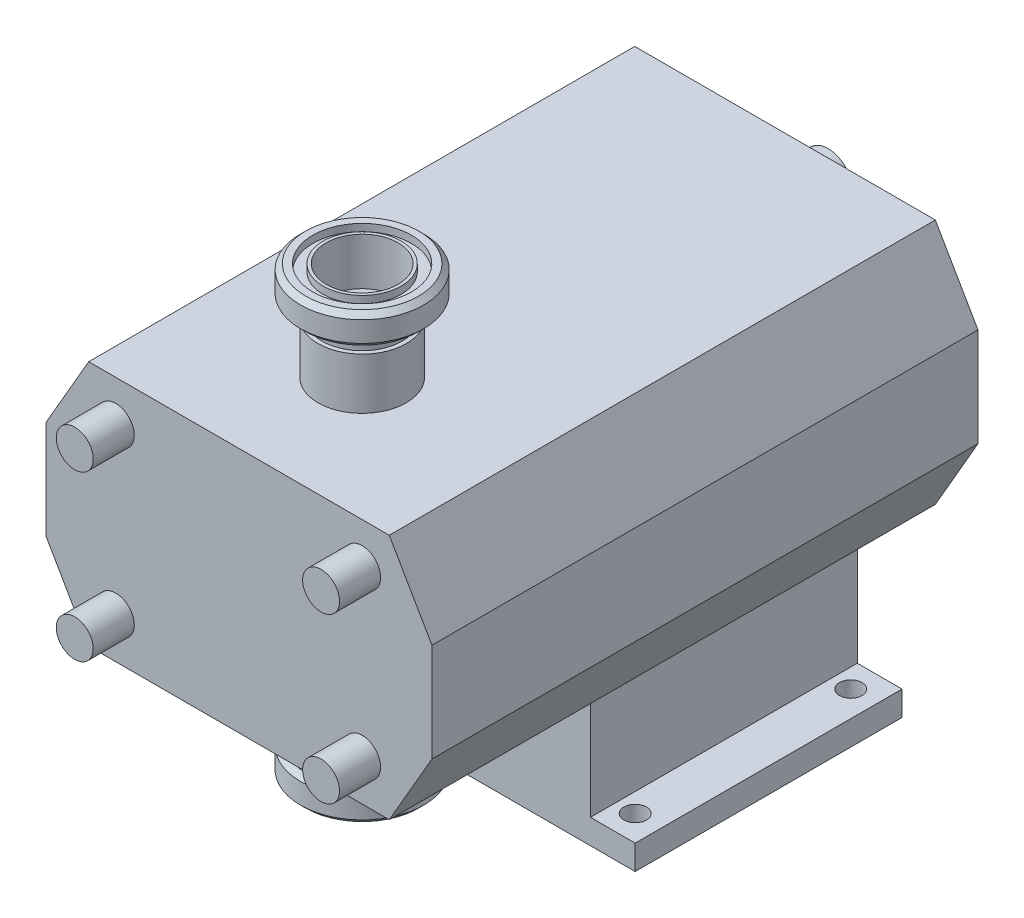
ISO-10303-21;
HEADER;
FILE_DESCRIPTION(('STEP AP214'),'2;1');
FILE_NAME('part.step','',(''),(''),'','','');
FILE_SCHEMA(('AUTOMOTIVE_DESIGN { 1 0 10303 214 1 1 1 1 }'));
ENDSEC;
DATA;
#1=APPLICATION_CONTEXT('core data for automotive mechanical design processes');
#2=APPLICATION_PROTOCOL_DEFINITION('international standard','automotive_design',2000,#1);
#3=PRODUCT_CONTEXT('',#1,'mechanical');
#4=PRODUCT('Part','Part','',(#3));
#5=PRODUCT_RELATED_PRODUCT_CATEGORY('part','',(#4));
#6=PRODUCT_DEFINITION_FORMATION('','',#4);
#7=PRODUCT_DEFINITION_CONTEXT('part definition',#1,'design');
#8=PRODUCT_DEFINITION('design','',#6,#7);
#9=PRODUCT_DEFINITION_SHAPE('','',#8);
#10=(LENGTH_UNIT() NAMED_UNIT(*) SI_UNIT(.MILLI.,.METRE.));
#11=(NAMED_UNIT(*) PLANE_ANGLE_UNIT() SI_UNIT($,.RADIAN.));
#12=(NAMED_UNIT(*) SI_UNIT($,.STERADIAN.) SOLID_ANGLE_UNIT());
#13=UNCERTAINTY_MEASURE_WITH_UNIT(LENGTH_MEASURE(1.E-05),#10,'distance_accuracy_value','');
#14=(GEOMETRIC_REPRESENTATION_CONTEXT(3) GLOBAL_UNCERTAINTY_ASSIGNED_CONTEXT((#13)) GLOBAL_UNIT_ASSIGNED_CONTEXT((#10,
#11,#12)) REPRESENTATION_CONTEXT('',''));
#15=CARTESIAN_POINT('',(0.,0.,0.));
#16=DIRECTION('',(0.,0.,1.));
#17=DIRECTION('',(1.,0.,0.));
#18=AXIS2_PLACEMENT_3D('',#15,#16,#17);
#19=CARTESIAN_POINT('',(16.0545380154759,104.5,216.161289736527));
#20=DIRECTION('',(0.,1.,0.));
#21=DIRECTION('',(-0.534804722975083,0.,0.844975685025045));
#22=AXIS2_PLACEMENT_3D('',#19,#20,#21);
#23=PLANE('',#22);
#24=CARTESIAN_POINT('',(0.,104.5,206.));
#25=DIRECTION('',(0.,-1.,0.));
#26=DIRECTION('',(0.534804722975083,0.,-0.844975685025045));
#27=AXIS2_PLACEMENT_3D('',#24,#25,#26);
#28=CIRCLE('',#27,19.);
#29=CARTESIAN_POINT('',(10.1612897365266,104.5,189.945461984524));
#30=VERTEX_POINT('',#29);
#31=EDGE_CURVE('P0_E58',#30,#30,#28,.T.);
#32=ORIENTED_EDGE('',*,*,#31,.T.);
#33=EDGE_LOOP('',(#32));
#34=FACE_BOUND('',#33,.T.);
#35=CARTESIAN_POINT('',(0.,104.5,206.));
#36=DIRECTION('',(0.,-1.,0.));
#37=DIRECTION('',(0.534804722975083,0.,-0.844975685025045));
#38=AXIS2_PLACEMENT_3D('',#35,#36,#37);
#39=CIRCLE('',#38,24.);
#40=CARTESIAN_POINT('',(12.835313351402,104.5,185.720583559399));
#41=VERTEX_POINT('',#40);
#42=EDGE_CURVE('P0_E10',#41,#41,#39,.T.);
#43=ORIENTED_EDGE('',*,*,#42,.F.);
#44=EDGE_LOOP('',(#43));
#45=FACE_BOUND('',#44,.T.);
#46=ADVANCED_FACE('P0_F15',(#34,#45),#23,.T.);
#47=CARTESIAN_POINT('',(0.,85.,206.));
#48=DIRECTION('',(0.,-1.,0.));
#49=DIRECTION('',(0.534804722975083,0.,-0.844975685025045));
#50=AXIS2_PLACEMENT_3D('',#47,#48,#49);
#51=CYLINDRICAL_SURFACE('',#50,24.);
#52=ORIENTED_EDGE('',*,*,#42,.T.);
#53=EDGE_LOOP('',(#52));
#54=FACE_BOUND('',#53,.T.);
#55=CARTESIAN_POINT('',(0.,108.,206.));
#56=DIRECTION('',(0.,-1.,0.));
#57=DIRECTION('',(0.534804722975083,0.,-0.844975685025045));
#58=AXIS2_PLACEMENT_3D('',#55,#56,#57);
#59=CIRCLE('',#58,24.);
#60=CARTESIAN_POINT('',(12.835313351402,108.,185.720583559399));
#61=VERTEX_POINT('',#60);
#62=EDGE_CURVE('P0_E21',#61,#61,#59,.T.);
#63=ORIENTED_EDGE('',*,*,#62,.F.);
#64=EDGE_LOOP('',(#63));
#65=FACE_BOUND('',#64,.T.);
#66=ADVANCED_FACE('P0_F77',(#54,#65),#51,.F.);
#67=CARTESIAN_POINT('',(20.2794164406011,108.,218.835313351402));
#68=DIRECTION('',(0.,1.,0.));
#69=DIRECTION('',(-0.534804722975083,0.,0.844975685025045));
#70=AXIS2_PLACEMENT_3D('',#67,#68,#69);
#71=PLANE('',#70);
#72=ORIENTED_EDGE('',*,*,#62,.T.);
#73=EDGE_LOOP('',(#72));
#74=FACE_BOUND('',#73,.T.);
#75=CARTESIAN_POINT('',(0.,108.,206.));
#76=DIRECTION('',(0.,-1.,0.));
#77=DIRECTION('',(0.534804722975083,0.,-0.844975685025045));
#78=AXIS2_PLACEMENT_3D('',#75,#76,#77);
#79=CIRCLE('',#78,27.5);
#80=CARTESIAN_POINT('',(14.7071298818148,108.,182.763168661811));
#81=VERTEX_POINT('',#80);
#82=EDGE_CURVE('P0_E25',#81,#81,#79,.T.);
#83=ORIENTED_EDGE('',*,*,#82,.F.);
#84=EDGE_LOOP('',(#83));
#85=FACE_BOUND('',#84,.T.);
#86=ADVANCED_FACE('P0_F81',(#74,#85),#71,.T.);
#87=CARTESIAN_POINT('',(0.,105.5,206.));
#88=DIRECTION('',(0.,-1.,0.));
#89=DIRECTION('',(0.534804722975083,0.,-0.844975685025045));
#90=AXIS2_PLACEMENT_3D('',#87,#88,#89);
#91=CONICAL_SURFACE('',#90,30.,0.785398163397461);
#92=ORIENTED_EDGE('',*,*,#82,.T.);
#93=EDGE_LOOP('',(#92));
#94=FACE_BOUND('',#93,.T.);
#95=CARTESIAN_POINT('',(0.,105.5,206.));
#96=DIRECTION('',(0.,-1.,0.));
#97=DIRECTION('',(0.534804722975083,0.,-0.844975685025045));
#98=AXIS2_PLACEMENT_3D('',#95,#96,#97);
#99=CIRCLE('',#98,30.);
#100=CARTESIAN_POINT('',(16.0441416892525,105.5,180.650729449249));
#101=VERTEX_POINT('',#100);
#102=EDGE_CURVE('P0_E29',#101,#101,#99,.T.);
#103=ORIENTED_EDGE('',*,*,#102,.F.);
#104=EDGE_LOOP('',(#103));
#105=FACE_BOUND('',#104,.T.);
#106=ADVANCED_FACE('P0_F85',(#94,#105),#91,.T.);
#107=CARTESIAN_POINT('',(0.,85.,206.));
#108=DIRECTION('',(0.,-1.,0.));
#109=DIRECTION('',(0.534804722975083,0.,-0.844975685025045));
#110=AXIS2_PLACEMENT_3D('',#107,#108,#109);
#111=CYLINDRICAL_SURFACE('',#110,30.);
#112=ORIENTED_EDGE('',*,*,#102,.T.);
#113=EDGE_LOOP('',(#112));
#114=FACE_BOUND('',#113,.T.);
#115=CARTESIAN_POINT('',(0.,95.5,206.));
#116=DIRECTION('',(0.,-1.,0.));
#117=DIRECTION('',(0.534804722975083,0.,-0.844975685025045));
#118=AXIS2_PLACEMENT_3D('',#115,#116,#117);
#119=CIRCLE('',#118,30.);
#120=CARTESIAN_POINT('',(16.0441416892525,95.5,180.650729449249));
#121=VERTEX_POINT('',#120);
#122=EDGE_CURVE('P0_E34',#121,#121,#119,.T.);
#123=ORIENTED_EDGE('',*,*,#122,.F.);
#124=EDGE_LOOP('',(#123));
#125=FACE_BOUND('',#124,.T.);
#126=ADVANCED_FACE('P0_F91',(#114,#125),#111,.T.);
#127=CARTESIAN_POINT('',(0.,93.,206.));
#128=DIRECTION('',(0.,1.,0.));
#129=DIRECTION('',(-0.534804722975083,0.,0.844975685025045));
#130=AXIS2_PLACEMENT_3D('',#127,#128,#129);
#131=CONICAL_SURFACE('',#130,27.5,0.785398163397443);
#132=ORIENTED_EDGE('',*,*,#122,.T.);
#133=EDGE_LOOP('',(#132));
#134=FACE_BOUND('',#133,.T.);
#135=CARTESIAN_POINT('',(0.,93.,206.));
#136=DIRECTION('',(0.,-1.,0.));
#137=DIRECTION('',(0.534804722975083,0.,-0.844975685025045));
#138=AXIS2_PLACEMENT_3D('',#135,#136,#137);
#139=CIRCLE('',#138,27.5);
#140=CARTESIAN_POINT('',(14.7071298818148,93.,182.763168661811));
#141=VERTEX_POINT('',#140);
#142=EDGE_CURVE('P0_E37',#141,#141,#139,.T.);
#143=ORIENTED_EDGE('',*,*,#142,.F.);
#144=EDGE_LOOP('',(#143));
#145=FACE_BOUND('',#144,.T.);
#146=ADVANCED_FACE('P0_F95',(#134,#145),#131,.T.);
#147=CARTESIAN_POINT('',(23.2368313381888,93.,220.707129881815));
#148=DIRECTION('',(0.,-1.,0.));
#149=DIRECTION('',(0.534804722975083,0.,-0.844975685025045));
#150=AXIS2_PLACEMENT_3D('',#147,#148,#149);
#151=PLANE('',#150);
#152=ORIENTED_EDGE('',*,*,#142,.T.);
#153=EDGE_LOOP('',(#152));
#154=FACE_BOUND('',#153,.T.);
#155=CARTESIAN_POINT('',(0.,93.,206.));
#156=DIRECTION('',(0.,-1.,0.));
#157=DIRECTION('',(0.534804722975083,0.,-0.844975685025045));
#158=AXIS2_PLACEMENT_3D('',#155,#156,#157);
#159=CIRCLE('',#158,22.);
#160=CARTESIAN_POINT('',(11.7657039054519,93.,187.410534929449));
#161=VERTEX_POINT('',#160);
#162=EDGE_CURVE('P0_E40',#161,#161,#159,.T.);
#163=ORIENTED_EDGE('',*,*,#162,.F.);
#164=EDGE_LOOP('',(#163));
#165=FACE_BOUND('',#164,.T.);
#166=ADVANCED_FACE('P0_F99',(#154,#165),#151,.T.);
#167=CARTESIAN_POINT('',(0.,90.5,206.));
#168=DIRECTION('',(0.,-1.,0.));
#169=DIRECTION('',(0.534804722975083,0.,-0.844975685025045));
#170=AXIS2_PLACEMENT_3D('',#167,#168,#169);
#171=TOROIDAL_SURFACE('',#170,22.,2.5);
#172=ORIENTED_EDGE('',*,*,#162,.T.);
#173=EDGE_LOOP('',(#172));
#174=FACE_BOUND('',#173,.T.);
#175=CARTESIAN_POINT('',(0.,90.5,206.));
#176=DIRECTION('',(0.,-1.,0.));
#177=DIRECTION('',(0.534804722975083,0.,-0.844975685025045));
#178=AXIS2_PLACEMENT_3D('',#175,#176,#177);
#179=CIRCLE('',#178,19.5);
#180=CARTESIAN_POINT('',(10.4286920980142,90.5,189.522974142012));
#181=VERTEX_POINT('',#180);
#182=EDGE_CURVE('P0_E43',#181,#181,#179,.T.);
#183=ORIENTED_EDGE('',*,*,#182,.F.);
#184=EDGE_LOOP('',(#183));
#185=FACE_BOUND('',#184,.T.);
#186=ADVANCED_FACE('P0_F103',(#174,#185),#171,.F.);
#187=CARTESIAN_POINT('',(0.,85.,206.));
#188=DIRECTION('',(0.,-1.,0.));
#189=DIRECTION('',(0.534804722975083,0.,-0.844975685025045));
#190=AXIS2_PLACEMENT_3D('',#187,#188,#189);
#191=CYLINDRICAL_SURFACE('',#190,19.5);
#192=ORIENTED_EDGE('',*,*,#182,.T.);
#193=EDGE_LOOP('',(#192));
#194=FACE_BOUND('',#193,.T.);
#195=CARTESIAN_POINT('',(0.,85.,206.));
#196=DIRECTION('',(0.,-1.,0.));
#197=DIRECTION('',(0.534804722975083,0.,-0.844975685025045));
#198=AXIS2_PLACEMENT_3D('',#195,#196,#197);
#199=CIRCLE('',#198,19.5);
#200=CARTESIAN_POINT('',(10.4286920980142,85.,189.522974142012));
#201=VERTEX_POINT('',#200);
#202=EDGE_CURVE('P0_E46',#201,#201,#199,.T.);
#203=ORIENTED_EDGE('',*,*,#202,.F.);
#204=EDGE_LOOP('',(#203));
#205=FACE_BOUND('',#204,.T.);
#206=ADVANCED_FACE('P0_F107',(#194,#205),#191,.T.);
#207=CARTESIAN_POINT('',(16.4770258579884,85.,216.428692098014));
#208=DIRECTION('',(0.,-1.,0.));
#209=DIRECTION('',(0.534804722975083,0.,-0.844975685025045));
#210=AXIS2_PLACEMENT_3D('',#207,#208,#209);
#211=PLANE('',#210);
#212=ORIENTED_EDGE('',*,*,#202,.T.);
#213=EDGE_LOOP('',(#212));
#214=FACE_BOUND('',#213,.T.);
#215=CARTESIAN_POINT('',(0.,85.,206.));
#216=DIRECTION('',(0.,-1.,0.));
#217=DIRECTION('',(0.534804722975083,0.,-0.844975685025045));
#218=AXIS2_PLACEMENT_3D('',#215,#216,#217);
#219=CIRCLE('',#218,17.55);
#220=CARTESIAN_POINT('',(9.38582288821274,85.,191.17067672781));
#221=VERTEX_POINT('',#220);
#222=EDGE_CURVE('P0_E49',#221,#221,#219,.T.);
#223=ORIENTED_EDGE('',*,*,#222,.F.);
#224=EDGE_LOOP('',(#223));
#225=FACE_BOUND('',#224,.T.);
#226=ADVANCED_FACE('P0_F111',(#214,#225),#211,.T.);
#227=CARTESIAN_POINT('',(0.,85.,206.));
#228=DIRECTION('',(0.,-1.,0.));
#229=DIRECTION('',(0.534804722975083,0.,-0.844975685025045));
#230=AXIS2_PLACEMENT_3D('',#227,#228,#229);
#231=CYLINDRICAL_SURFACE('',#230,17.55);
#232=ORIENTED_EDGE('',*,*,#222,.T.);
#233=EDGE_LOOP('',(#232));
#234=FACE_BOUND('',#233,.T.);
#235=CARTESIAN_POINT('',(0.,108.,206.));
#236=DIRECTION('',(0.,-1.,0.));
#237=DIRECTION('',(0.534804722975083,0.,-0.844975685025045));
#238=AXIS2_PLACEMENT_3D('',#235,#236,#237);
#239=CIRCLE('',#238,17.55);
#240=CARTESIAN_POINT('',(9.38582288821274,108.,191.17067672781));
#241=VERTEX_POINT('',#240);
#242=EDGE_CURVE('P0_E52',#241,#241,#239,.T.);
#243=ORIENTED_EDGE('',*,*,#242,.F.);
#244=EDGE_LOOP('',(#243));
#245=FACE_BOUND('',#244,.T.);
#246=ADVANCED_FACE('P0_F73',(#234,#245),#231,.F.);
#247=CARTESIAN_POINT('',(14.8293232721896,108.,215.385822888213));
#248=DIRECTION('',(0.,1.,0.));
#249=DIRECTION('',(-0.534804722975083,0.,0.844975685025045));
#250=AXIS2_PLACEMENT_3D('',#247,#248,#249);
#251=PLANE('',#250);
#252=ORIENTED_EDGE('',*,*,#242,.T.);
#253=EDGE_LOOP('',(#252));
#254=FACE_BOUND('',#253,.T.);
#255=CARTESIAN_POINT('',(0.,108.,206.));
#256=DIRECTION('',(0.,-1.,0.));
#257=DIRECTION('',(0.534804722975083,0.,-0.844975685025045));
#258=AXIS2_PLACEMENT_3D('',#255,#256,#257);
#259=CIRCLE('',#258,19.);
#260=CARTESIAN_POINT('',(10.1612897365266,108.,189.945461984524));
#261=VERTEX_POINT('',#260);
#262=EDGE_CURVE('P0_E55',#261,#261,#259,.T.);
#263=ORIENTED_EDGE('',*,*,#262,.F.);
#264=EDGE_LOOP('',(#263));
#265=FACE_BOUND('',#264,.T.);
#266=ADVANCED_FACE('P0_F66',(#254,#265),#251,.T.);
#267=CARTESIAN_POINT('',(0.,85.,206.));
#268=DIRECTION('',(0.,-1.,0.));
#269=DIRECTION('',(0.534804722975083,0.,-0.844975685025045));
#270=AXIS2_PLACEMENT_3D('',#267,#268,#269);
#271=CYLINDRICAL_SURFACE('',#270,19.);
#272=ORIENTED_EDGE('',*,*,#262,.T.);
#273=EDGE_LOOP('',(#272));
#274=FACE_BOUND('',#273,.T.);
#275=ORIENTED_EDGE('',*,*,#31,.F.);
#276=EDGE_LOOP('',(#275));
#277=FACE_BOUND('',#276,.T.);
#278=ADVANCED_FACE('P0_F64',(#274,#277),#271,.T.);
#279=CLOSED_SHELL('',(#46,#66,#86,#106,#126,#146,#166,#186,#206,#226,#246,#266,#278));
#280=MANIFOLD_SOLID_BREP('P0_B1',#279);
#281=CARTESIAN_POINT('',(-31.,0.,241.732657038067));
#282=DIRECTION('',(0.,0.,1.));
#283=DIRECTION('',(1.,0.,0.));
#284=AXIS2_PLACEMENT_3D('',#281,#282,#283);
#285=CYLINDRICAL_SURFACE('',#284,12.);
#286=CARTESIAN_POINT('',(-31.,0.,-2.));
#287=DIRECTION('',(0.,0.,1.));
#288=DIRECTION('',(1.,0.,0.));
#289=AXIS2_PLACEMENT_3D('',#286,#287,#288);
#290=CIRCLE('',#289,12.);
#291=CARTESIAN_POINT('',(-19.,0.,-2.));
#292=VERTEX_POINT('',#291);
#293=EDGE_CURVE('P1_E277',#292,#292,#290,.T.);
#294=ORIENTED_EDGE('',*,*,#293,.F.);
#295=EDGE_LOOP('',(#294));
#296=FACE_BOUND('',#295,.T.);
#297=DIRECTION('',(0.,0.,1.));
#298=VECTOR('',#297,1.);
#299=CARTESIAN_POINT('',(-19.6862915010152,3.99999999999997,241.732657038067));
#300=LINE('',#299,#298);
#301=CARTESIAN_POINT('',(-19.6862915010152,4.,-52.));
#302=VERTEX_POINT('',#301);
#303=CARTESIAN_POINT('',(-19.6862915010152,4.,-22.));
#304=VERTEX_POINT('',#303);
#305=EDGE_CURVE('P1_E178',#302,#304,#300,.T.);
#306=ORIENTED_EDGE('',*,*,#305,.F.);
#307=CARTESIAN_POINT('',(-31.,0.,-52.));
#308=DIRECTION('',(0.,0.,1.));
#309=DIRECTION('',(1.,0.,0.));
#310=AXIS2_PLACEMENT_3D('',#307,#308,#309);
#311=CIRCLE('',#310,12.);
#312=CARTESIAN_POINT('',(-19.6862915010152,-4.,-52.));
#313=VERTEX_POINT('',#312);
#314=EDGE_CURVE('P1_E176',#302,#313,#311,.T.);
#315=ORIENTED_EDGE('',*,*,#314,.T.);
#316=DIRECTION('',(0.,0.,1.));
#317=VECTOR('',#316,1.);
#318=CARTESIAN_POINT('',(-19.6862915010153,-4.00000000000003,241.732657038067));
#319=LINE('',#318,#317);
#320=CARTESIAN_POINT('',(-19.6862915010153,-4.00000000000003,-22.));
#321=VERTEX_POINT('',#320);
#322=EDGE_CURVE('P1_E39',#321,#313,#319,.F.);
#323=ORIENTED_EDGE('',*,*,#322,.F.);
#324=CARTESIAN_POINT('',(-19.,0.,-26.));
#325=CARTESIAN_POINT('',(-18.9999993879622,0.218253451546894,-26.0000010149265));
#326=CARTESIAN_POINT('',(-19.0060092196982,0.436500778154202,-25.9820789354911));
#327=CARTESIAN_POINT('',(-19.0293915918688,0.866567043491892,-25.9110835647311));
#328=CARTESIAN_POINT('',(-19.0467653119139,1.07838531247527,-25.8580066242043));
#329=CARTESIAN_POINT('',(-19.0909876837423,1.4893311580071,-25.7187230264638));
#330=CARTESIAN_POINT('',(-19.1178204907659,1.68847930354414,-25.6325717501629));
#331=CARTESIAN_POINT('',(-19.1782221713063,2.0694997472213,-25.4298353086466));
#332=CARTESIAN_POINT('',(-19.2117923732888,2.25136862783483,-25.3132441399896));
#333=CARTESIAN_POINT('',(-19.2834362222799,2.59896670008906,-25.048696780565));
#334=CARTESIAN_POINT('',(-19.3216177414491,2.76401480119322,-24.899875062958));
#335=CARTESIAN_POINT('',(-19.3975874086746,3.06733077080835,-24.5769313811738));
#336=CARTESIAN_POINT('',(-19.4353754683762,3.20559274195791,-24.4028038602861));
#337=CARTESIAN_POINT('',(-19.5074667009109,3.45529976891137,-24.028059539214));
#338=CARTESIAN_POINT('',(-19.5416384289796,3.5658594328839,-23.826825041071));
#339=CARTESIAN_POINT('',(-19.6009877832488,3.75127549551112,-23.4072956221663));
#340=CARTESIAN_POINT('',(-19.6261681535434,3.82614278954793,-23.1890059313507));
#341=CARTESIAN_POINT('',(-19.6635478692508,3.93549384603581,-22.7493071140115));
#342=CARTESIAN_POINT('',(-19.6761561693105,3.97125379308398,-22.5282511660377));
#343=CARTESIAN_POINT('',(-19.6881737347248,4.005364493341,-22.0829449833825));
#344=CARTESIAN_POINT('',(-19.687587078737,4.00372680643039,-21.8586957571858));
#345=CARTESIAN_POINT('',(-19.6736394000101,3.96407961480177,-21.4242534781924));
#346=CARTESIAN_POINT('',(-19.6608633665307,3.92773565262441,-21.2138863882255));
#347=CARTESIAN_POINT('',(-19.6249336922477,3.82242465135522,-20.8024263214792));
#348=CARTESIAN_POINT('',(-19.6017788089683,3.75345370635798,-20.601334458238));
#349=CARTESIAN_POINT('',(-19.5472835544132,3.58375623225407,-20.2103490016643));
#350=CARTESIAN_POINT('',(-19.5158173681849,3.4825361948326,-20.02068789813));
#351=CARTESIAN_POINT('',(-19.4482976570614,3.251556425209,-19.660516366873));
#352=CARTESIAN_POINT('',(-19.4122428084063,3.12178844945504,-19.4900114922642));
#353=CARTESIAN_POINT('',(-19.3373068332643,2.82939733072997,-19.1636336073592));
#354=CARTESIAN_POINT('',(-19.2983764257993,2.66541260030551,-19.0089892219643));
#355=CARTESIAN_POINT('',(-19.2237224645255,2.31335827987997,-18.7290749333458));
#356=CARTESIAN_POINT('',(-19.1879992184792,2.12528638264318,-18.6038078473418));
#357=CARTESIAN_POINT('',(-19.1233156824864,1.72779045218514,-18.3852147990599));
#358=CARTESIAN_POINT('',(-19.0944259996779,1.51817310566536,-18.2922180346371));
#359=CARTESIAN_POINT('',(-19.0471773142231,1.085076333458,-18.1431873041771));
#360=CARTESIAN_POINT('',(-19.028814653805,0.861601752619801,-18.0871404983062));
#361=CARTESIAN_POINT('',(-19.0052949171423,0.417535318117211,-18.0157773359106));
#362=CARTESIAN_POINT('',(-18.9995999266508,0.197238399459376,-17.998800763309));
#363=CARTESIAN_POINT('',(-19.0004438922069,-0.24310027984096,-18.0013306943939));
#364=CARTESIAN_POINT('',(-19.0069807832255,-0.463142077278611,-18.0208310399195));
#365=CARTESIAN_POINT('',(-19.0311990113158,-0.89007946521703,-18.0944476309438));
#366=CARTESIAN_POINT('',(-19.0485520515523,-1.09717122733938,-18.147544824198));
#367=CARTESIAN_POINT('',(-19.0923261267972,-1.4994238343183,-18.2855737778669));
#368=CARTESIAN_POINT('',(-19.118748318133,-1.69458315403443,-18.3705095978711));
#369=CARTESIAN_POINT('',(-19.1788427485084,-2.0731531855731,-18.5722817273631));
#370=CARTESIAN_POINT('',(-19.2126874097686,-2.25611983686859,-18.6898983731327));
#371=CARTESIAN_POINT('',(-19.2837898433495,-2.60025932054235,-18.9527766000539));
#372=CARTESIAN_POINT('',(-19.3210486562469,-2.76142547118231,-19.0980466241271));
#373=CARTESIAN_POINT('',(-19.3969260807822,-3.06501003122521,-19.4199150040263));
#374=CARTESIAN_POINT('',(-19.4355295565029,-3.20624387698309,-19.5976369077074));
#375=CARTESIAN_POINT('',(-19.5080010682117,-3.45703008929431,-19.9750862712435));
#376=CARTESIAN_POINT('',(-19.5418690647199,-3.56658219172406,-20.1748139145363));
#377=CARTESIAN_POINT('',(-19.6007043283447,-3.75038772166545,-20.5906920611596));
#378=CARTESIAN_POINT('',(-19.6256895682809,-3.82471252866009,-20.8068083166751));
#379=CARTESIAN_POINT('',(-19.663566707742,-3.93557866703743,-21.2495146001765));
#380=CARTESIAN_POINT('',(-19.6764640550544,-3.97213701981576,-21.4760998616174));
#381=CARTESIAN_POINT('',(-19.6880856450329,-4.00510512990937,-21.9207883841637));
#382=CARTESIAN_POINT('',(-19.6875039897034,-4.0034810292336,-22.1387293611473));
#383=CARTESIAN_POINT('',(-19.6739492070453,-3.96496917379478,-22.5710602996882));
#384=CARTESIAN_POINT('',(-19.6609768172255,-3.92808351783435,-22.7854504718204));
#385=CARTESIAN_POINT('',(-19.6246190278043,-3.82148725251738,-23.2005426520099));
#386=CARTESIAN_POINT('',(-19.6014360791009,-3.75241338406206,-23.401427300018));
#387=CARTESIAN_POINT('',(-19.5473440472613,-3.58391746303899,-23.7889096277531));
#388=CARTESIAN_POINT('',(-19.5164332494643,-3.48448867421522,-23.975504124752));
#389=CARTESIAN_POINT('',(-19.4486868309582,-3.25304277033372,-24.3379346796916));
#390=CARTESIAN_POINT('',(-19.4116515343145,-3.11979297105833,-24.5129460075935));
#391=CARTESIAN_POINT('',(-19.3366657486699,-2.8265715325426,-24.8387592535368));
#392=CARTESIAN_POINT('',(-19.2987150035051,-2.66659233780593,-24.9895543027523));
#393=CARTESIAN_POINT('',(-19.2243987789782,-2.31696622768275,-25.2685776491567));
#394=CARTESIAN_POINT('',(-19.1881527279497,-2.12640605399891,-25.395697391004));
#395=CARTESIAN_POINT('',(-19.1229603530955,-1.7254294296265,-25.6159617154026));
#396=CARTESIAN_POINT('',(-19.0940121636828,-1.51501807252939,-25.7091149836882));
#397=CARTESIAN_POINT('',(-19.0477793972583,-1.0899745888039,-25.8548865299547));
#398=CARTESIAN_POINT('',(-19.0300315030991,-0.875951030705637,-25.9091298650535));
#399=CARTESIAN_POINT('',(-19.0061437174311,-0.441281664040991,-25.9816811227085));
#400=CARTESIAN_POINT('',(-19.0000006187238,-0.220637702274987,-25.9999989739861));
#401=CARTESIAN_POINT('',(-19.,0.,-26.));
#402=B_SPLINE_CURVE_WITH_KNOTS('',3,(#324,#325,#326,#327,#328,#329,#330,#331,#332,#333,#334,
#335,#336,#337,#338,#339,#340,#341,#342,#343,#344,#345,#346,#347,#348,#349,#350,#351,#352,#353,
#354,#355,#356,#357,#358,#359,#360,#361,#362,#363,#364,#365,#366,#367,#368,#369,#370,#371,#372,
#373,#374,#375,#376,#377,#378,#379,#380,#381,#382,#383,#384,#385,#386,#387,#388,#389,#390,#391,
#392,#393,#394,#395,#396,#397,#398,#399,#400,#401),.UNSPECIFIED.,.T.,.F.,(4,2,2,2,2,2,2,2,2,2,2,
2,2,2,2,2,2,2,2,2,2,2,2,2,2,2,2,2,2,2,2,2,2,2,2,2,2,2,4),(0.,0.653948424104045,1.30796474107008,
1.96089069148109,2.6139455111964,3.28738737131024,3.96097733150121,4.65393539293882,
5.34668178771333,6.01607702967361,6.68526535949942,7.32387306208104,7.96255723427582,
8.61152684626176,9.26068410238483,9.94373223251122,10.6268458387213,11.3167362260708,
12.0063867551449,12.6661433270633,13.3257885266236,13.9663263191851,14.6069458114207,
15.264415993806,15.9220872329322,16.6096409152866,17.2972003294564,17.9833605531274,
18.6692113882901,19.3198266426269,19.9704031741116,20.6086234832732,21.2469855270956,
21.9132026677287,22.5796084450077,23.2719864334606,23.9641872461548,24.6254623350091,
25.2865546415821),.UNSPECIFIED.);
#403=EDGE_CURVE('P1_E11',#304,#321,#402,.T.);
#404=ORIENTED_EDGE('',*,*,#403,.F.);
#405=EDGE_LOOP('',(#306,#315,#323,#404));
#406=FACE_BOUND('',#405,.T.);
#407=ADVANCED_FACE('P1_F17',(#296,#406),#285,.T.);
#408=CARTESIAN_POINT('',(-73.2153903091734,-60.,266.));
#409=DIRECTION('',(0.,1.,0.));
#410=DIRECTION('',(-1.,0.,0.));
#411=AXIS2_PLACEMENT_3D('',#408,#409,#410);
#412=PLANE('',#411);
#413=CARTESIAN_POINT('',(0.,-60.,206.));
#414=DIRECTION('',(0.,1.,0.));
#415=DIRECTION('',(-1.,0.,0.));
#416=AXIS2_PLACEMENT_3D('',#413,#414,#415);
#417=CIRCLE('',#416,21.5);
#418=CARTESIAN_POINT('',(-21.5,-60.,206.));
#419=VERTEX_POINT('',#418);
#420=EDGE_CURVE('P1_E192',#419,#419,#417,.T.);
#421=ORIENTED_EDGE('',*,*,#420,.T.);
#422=EDGE_LOOP('',(#421));
#423=FACE_BOUND('',#422,.T.);
#424=DIRECTION('',(1.,0.,0.));
#425=VECTOR('',#424,1.);
#426=CARTESIAN_POINT('',(-73.2153903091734,-60.,0.));
#427=LINE('',#426,#425);
#428=CARTESIAN_POINT('',(-73.2153903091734,-60.,0.));
#429=VERTEX_POINT('',#428);
#430=CARTESIAN_POINT('',(73.2153903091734,-60.,0.));
#431=VERTEX_POINT('',#430);
#432=EDGE_CURVE('P1_E337',#429,#431,#427,.T.);
#433=ORIENTED_EDGE('',*,*,#432,.T.);
#434=DIRECTION('',(0.,0.,-1.));
#435=VECTOR('',#434,1.);
#436=CARTESIAN_POINT('',(73.2153903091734,-60.,266.));
#437=LINE('',#436,#435);
#438=CARTESIAN_POINT('',(73.2153903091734,-60.,266.));
#439=VERTEX_POINT('',#438);
#440=EDGE_CURVE('P1_E347',#439,#431,#437,.T.);
#441=ORIENTED_EDGE('',*,*,#440,.F.);
#442=DIRECTION('',(1.,0.,0.));
#443=VECTOR('',#442,1.);
#444=CARTESIAN_POINT('',(-73.2153903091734,-60.,266.));
#445=LINE('',#444,#443);
#446=CARTESIAN_POINT('',(-73.2153903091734,-60.,266.));
#447=VERTEX_POINT('',#446);
#448=EDGE_CURVE('P1_E320',#447,#439,#445,.T.);
#449=ORIENTED_EDGE('',*,*,#448,.F.);
#450=DIRECTION('',(0.,0.,-1.));
#451=VECTOR('',#450,1.);
#452=CARTESIAN_POINT('',(-73.2153903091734,-60.,266.));
#453=LINE('',#452,#451);
#454=EDGE_CURVE('P1_E350',#447,#429,#453,.T.);
#455=ORIENTED_EDGE('',*,*,#454,.T.);
#456=EDGE_LOOP('',(#433,#441,#449,#455));
#457=FACE_BOUND('',#456,.T.);
#458=DIRECTION('',(1.,0.,0.));
#459=VECTOR('',#458,1.);
#460=CARTESIAN_POINT('',(53.2153903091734,-60.,18.));
#461=LINE('',#460,#459);
#462=CARTESIAN_POINT('',(-53.2153903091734,-60.,18.));
#463=VERTEX_POINT('',#462);
#464=CARTESIAN_POINT('',(53.2153903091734,-60.,18.));
#465=VERTEX_POINT('',#464);
#466=EDGE_CURVE('P1_E220',#463,#465,#461,.T.);
#467=ORIENTED_EDGE('',*,*,#466,.F.);
#468=DIRECTION('',(0.,0.,1.));
#469=VECTOR('',#468,1.);
#470=CARTESIAN_POINT('',(-53.2153903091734,-60.,18.));
#471=LINE('',#470,#469);
#472=CARTESIAN_POINT('',(-53.2153903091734,-60.,148.));
#473=VERTEX_POINT('',#472);
#474=EDGE_CURVE('P1_E238',#463,#473,#471,.T.);
#475=ORIENTED_EDGE('',*,*,#474,.T.);
#476=DIRECTION('',(1.,0.,0.));
#477=VECTOR('',#476,1.);
#478=CARTESIAN_POINT('',(53.2153903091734,-60.,148.));
#479=LINE('',#478,#477);
#480=CARTESIAN_POINT('',(53.2153903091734,-60.,148.));
#481=VERTEX_POINT('',#480);
#482=EDGE_CURVE('P1_E219',#473,#481,#479,.T.);
#483=ORIENTED_EDGE('',*,*,#482,.T.);
#484=DIRECTION('',(0.,0.,1.));
#485=VECTOR('',#484,1.);
#486=CARTESIAN_POINT('',(53.2153903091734,-60.,18.));
#487=LINE('',#486,#485);
#488=EDGE_CURVE('P1_E274',#465,#481,#487,.T.);
#489=ORIENTED_EDGE('',*,*,#488,.F.);
#490=EDGE_LOOP('',(#467,#475,#483,#489));
#491=FACE_BOUND('',#490,.T.);
#492=ADVANCED_FACE('P1_F393',(#423,#457,#491),#412,.F.);
#493=CARTESIAN_POINT('',(107.856406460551,0.,0.));
#494=DIRECTION('',(0.,0.,1.));
#495=DIRECTION('',(1.,0.,0.));
#496=AXIS2_PLACEMENT_3D('',#493,#494,#495);
#497=PLANE('',#496);
#498=DIRECTION('',(-0.500000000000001,0.866025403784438,0.));
#499=VECTOR('',#498,1.);
#500=CARTESIAN_POINT('',(73.2153903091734,60.,0.));
#501=LINE('',#500,#499);
#502=CARTESIAN_POINT('',(94.,24.,0.));
#503=VERTEX_POINT('',#502);
#504=CARTESIAN_POINT('',(73.2153903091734,60.,0.));
#505=VERTEX_POINT('',#504);
#506=EDGE_CURVE('P1_E305',#503,#505,#501,.T.);
#507=ORIENTED_EDGE('',*,*,#506,.F.);
#508=DIRECTION('',(0.,1.,0.));
#509=VECTOR('',#508,1.);
#510=CARTESIAN_POINT('',(94.,24.,0.));
#511=LINE('',#510,#509);
#512=CARTESIAN_POINT('',(94.,-24.,0.));
#513=VERTEX_POINT('',#512);
#514=EDGE_CURVE('P1_E312',#513,#503,#511,.T.);
#515=ORIENTED_EDGE('',*,*,#514,.F.);
#516=DIRECTION('',(0.500000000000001,0.866025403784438,0.));
#517=VECTOR('',#516,1.);
#518=CARTESIAN_POINT('',(73.2153903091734,-60.,0.));
#519=LINE('',#518,#517);
#520=EDGE_CURVE('P1_E339',#431,#513,#519,.T.);
#521=ORIENTED_EDGE('',*,*,#520,.F.);
#522=ORIENTED_EDGE('',*,*,#432,.F.);
#523=DIRECTION('',(0.500000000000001,-0.866025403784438,0.));
#524=VECTOR('',#523,1.);
#525=CARTESIAN_POINT('',(-73.2153903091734,-60.,0.));
#526=LINE('',#525,#524);
#527=CARTESIAN_POINT('',(-94.,-24.,0.));
#528=VERTEX_POINT('',#527);
#529=EDGE_CURVE('P1_E335',#528,#429,#526,.T.);
#530=ORIENTED_EDGE('',*,*,#529,.F.);
#531=DIRECTION('',(0.,-1.,0.));
#532=VECTOR('',#531,1.);
#533=CARTESIAN_POINT('',(-94.,24.,0.));
#534=LINE('',#533,#532);
#535=CARTESIAN_POINT('',(-94.,24.,0.));
#536=VERTEX_POINT('',#535);
#537=EDGE_CURVE('P1_E333',#536,#528,#534,.T.);
#538=ORIENTED_EDGE('',*,*,#537,.F.);
#539=DIRECTION('',(-0.500000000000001,-0.866025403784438,0.));
#540=VECTOR('',#539,1.);
#541=CARTESIAN_POINT('',(-73.2153903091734,60.,0.));
#542=LINE('',#541,#540);
#543=CARTESIAN_POINT('',(-73.2153903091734,60.,0.));
#544=VERTEX_POINT('',#543);
#545=EDGE_CURVE('P1_E331',#544,#536,#542,.T.);
#546=ORIENTED_EDGE('',*,*,#545,.F.);
#547=DIRECTION('',(-1.,0.,0.));
#548=VECTOR('',#547,1.);
#549=CARTESIAN_POINT('',(-73.2153903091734,60.,0.));
#550=LINE('',#549,#548);
#551=EDGE_CURVE('P1_E329',#505,#544,#550,.T.);
#552=ORIENTED_EDGE('',*,*,#551,.F.);
#553=EDGE_LOOP('',(#507,#515,#521,#522,#530,#538,#546,#552));
#554=FACE_BOUND('',#553,.T.);
#555=CARTESIAN_POINT('',(-31.,0.,0.));
#556=DIRECTION('',(0.,0.,1.));
#557=DIRECTION('',(1.,0.,0.));
#558=AXIS2_PLACEMENT_3D('',#555,#556,#557);
#559=CIRCLE('',#558,15.);
#560=CARTESIAN_POINT('',(-16.,0.,0.));
#561=VERTEX_POINT('',#560);
#562=EDGE_CURVE('P1_E29',#561,#561,#559,.F.);
#563=ORIENTED_EDGE('',*,*,#562,.F.);
#564=EDGE_LOOP('',(#563));
#565=FACE_BOUND('',#564,.T.);
#566=ADVANCED_FACE('P1_F399',(#554,#565),#497,.F.);
#567=CARTESIAN_POINT('',(107.856406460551,0.,266.));
#568=DIRECTION('',(0.,0.,1.));
#569=DIRECTION('',(1.,0.,0.));
#570=AXIS2_PLACEMENT_3D('',#567,#568,#569);
#571=PLANE('',#570);
#572=CARTESIAN_POINT('',(60.,-40.,266.));
#573=DIRECTION('',(0.,0.,1.));
#574=DIRECTION('',(1.,0.,0.));
#575=AXIS2_PLACEMENT_3D('',#572,#573,#574);
#576=CIRCLE('',#575,9.);
#577=CARTESIAN_POINT('',(69.,-40.,266.));
#578=VERTEX_POINT('',#577);
#579=EDGE_CURVE('P1_E287',#578,#578,#576,.T.);
#580=ORIENTED_EDGE('',*,*,#579,.F.);
#581=EDGE_LOOP('',(#580));
#582=FACE_BOUND('',#581,.T.);
#583=CARTESIAN_POINT('',(-60.,40.,266.));
#584=DIRECTION('',(0.,0.,1.));
#585=DIRECTION('',(1.,0.,0.));
#586=AXIS2_PLACEMENT_3D('',#583,#584,#585);
#587=CIRCLE('',#586,9.);
#588=CARTESIAN_POINT('',(-51.,40.,266.));
#589=VERTEX_POINT('',#588);
#590=EDGE_CURVE('P1_E299',#589,#589,#587,.T.);
#591=ORIENTED_EDGE('',*,*,#590,.F.);
#592=EDGE_LOOP('',(#591));
#593=FACE_BOUND('',#592,.T.);
#594=DIRECTION('',(-0.500000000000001,0.866025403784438,0.));
#595=VECTOR('',#594,1.);
#596=CARTESIAN_POINT('',(73.2153903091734,60.,266.));
#597=LINE('',#596,#595);
#598=CARTESIAN_POINT('',(94.,24.,266.));
#599=VERTEX_POINT('',#598);
#600=CARTESIAN_POINT('',(73.2153903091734,60.,266.));
#601=VERTEX_POINT('',#600);
#602=EDGE_CURVE('P1_E308',#599,#601,#597,.T.);
#603=ORIENTED_EDGE('',*,*,#602,.T.);
#604=DIRECTION('',(-1.,0.,0.));
#605=VECTOR('',#604,1.);
#606=CARTESIAN_POINT('',(-73.2153903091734,60.,266.));
#607=LINE('',#606,#605);
#608=CARTESIAN_POINT('',(-73.2153903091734,60.,266.));
#609=VERTEX_POINT('',#608);
#610=EDGE_CURVE('P1_E311',#601,#609,#607,.T.);
#611=ORIENTED_EDGE('',*,*,#610,.T.);
#612=DIRECTION('',(-0.500000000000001,-0.866025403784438,0.));
#613=VECTOR('',#612,1.);
#614=CARTESIAN_POINT('',(-73.2153903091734,60.,266.));
#615=LINE('',#614,#613);
#616=CARTESIAN_POINT('',(-94.,24.,266.));
#617=VERTEX_POINT('',#616);
#618=EDGE_CURVE('P1_E314',#609,#617,#615,.T.);
#619=ORIENTED_EDGE('',*,*,#618,.T.);
#620=DIRECTION('',(0.,-1.,0.));
#621=VECTOR('',#620,1.);
#622=CARTESIAN_POINT('',(-94.,24.,266.));
#623=LINE('',#622,#621);
#624=CARTESIAN_POINT('',(-94.,-24.,266.));
#625=VERTEX_POINT('',#624);
#626=EDGE_CURVE('P1_E316',#617,#625,#623,.T.);
#627=ORIENTED_EDGE('',*,*,#626,.T.);
#628=DIRECTION('',(0.500000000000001,-0.866025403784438,0.));
#629=VECTOR('',#628,1.);
#630=CARTESIAN_POINT('',(-73.2153903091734,-60.,266.));
#631=LINE('',#630,#629);
#632=EDGE_CURVE('P1_E318',#625,#447,#631,.T.);
#633=ORIENTED_EDGE('',*,*,#632,.T.);
#634=ORIENTED_EDGE('',*,*,#448,.T.);
#635=DIRECTION('',(0.500000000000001,0.866025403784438,0.));
#636=VECTOR('',#635,1.);
#637=CARTESIAN_POINT('',(73.2153903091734,-60.,266.));
#638=LINE('',#637,#636);
#639=CARTESIAN_POINT('',(94.,-24.,266.));
#640=VERTEX_POINT('',#639);
#641=EDGE_CURVE('P1_E322',#439,#640,#638,.T.);
#642=ORIENTED_EDGE('',*,*,#641,.T.);
#643=DIRECTION('',(0.,1.,0.));
#644=VECTOR('',#643,1.);
#645=CARTESIAN_POINT('',(94.,24.,266.));
#646=LINE('',#645,#644);
#647=EDGE_CURVE('P1_E324',#640,#599,#646,.T.);
#648=ORIENTED_EDGE('',*,*,#647,.T.);
#649=EDGE_LOOP('',(#603,#611,#619,#627,#633,#634,#642,#648));
#650=FACE_BOUND('',#649,.T.);
#651=CARTESIAN_POINT('',(60.,40.,266.));
#652=DIRECTION('',(0.,0.,1.));
#653=DIRECTION('',(1.,0.,0.));
#654=AXIS2_PLACEMENT_3D('',#651,#652,#653);
#655=CIRCLE('',#654,9.);
#656=CARTESIAN_POINT('',(69.,40.,266.));
#657=VERTEX_POINT('',#656);
#658=EDGE_CURVE('P1_E293',#657,#657,#655,.T.);
#659=ORIENTED_EDGE('',*,*,#658,.F.);
#660=EDGE_LOOP('',(#659));
#661=FACE_BOUND('',#660,.T.);
#662=CARTESIAN_POINT('',(-60.,-40.,266.));
#663=DIRECTION('',(0.,0.,1.));
#664=DIRECTION('',(1.,0.,0.));
#665=AXIS2_PLACEMENT_3D('',#662,#663,#664);
#666=CIRCLE('',#665,9.);
#667=CARTESIAN_POINT('',(-51.,-40.,266.));
#668=VERTEX_POINT('',#667);
#669=EDGE_CURVE('P1_E283',#668,#668,#666,.T.);
#670=ORIENTED_EDGE('',*,*,#669,.F.);
#671=EDGE_LOOP('',(#670));
#672=FACE_BOUND('',#671,.T.);
#673=ADVANCED_FACE('P1_F448',(#582,#593,#650,#661,#672),#571,.T.);
#674=CARTESIAN_POINT('',(73.2153903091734,60.,266.));
#675=DIRECTION('',(-0.866025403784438,-0.500000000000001,0.));
#676=DIRECTION('',(0.500000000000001,-0.866025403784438,0.));
#677=AXIS2_PLACEMENT_3D('',#674,#675,#676);
#678=PLANE('',#677);
#679=ORIENTED_EDGE('',*,*,#506,.T.);
#680=DIRECTION('',(0.,0.,-1.));
#681=VECTOR('',#680,1.);
#682=CARTESIAN_POINT('',(73.2153903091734,60.,266.));
#683=LINE('',#682,#681);
#684=EDGE_CURVE('P1_E362',#601,#505,#683,.T.);
#685=ORIENTED_EDGE('',*,*,#684,.F.);
#686=ORIENTED_EDGE('',*,*,#602,.F.);
#687=DIRECTION('',(0.,0.,-1.));
#688=VECTOR('',#687,1.);
#689=CARTESIAN_POINT('',(94.,24.,266.));
#690=LINE('',#689,#688);
#691=EDGE_CURVE('P1_E326',#599,#503,#690,.T.);
#692=ORIENTED_EDGE('',*,*,#691,.T.);
#693=EDGE_LOOP('',(#679,#685,#686,#692));
#694=FACE_BOUND('',#693,.T.);
#695=ADVANCED_FACE('P1_F19',(#694),#678,.F.);
#696=CARTESIAN_POINT('',(-73.2153903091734,60.,266.));
#697=DIRECTION('',(0.,-1.,0.));
#698=DIRECTION('',(1.,0.,0.));
#699=AXIS2_PLACEMENT_3D('',#696,#697,#698);
#700=PLANE('',#699);
#701=CARTESIAN_POINT('',(0.,60.,206.));
#702=DIRECTION('',(0.,-1.,0.));
#703=DIRECTION('',(1.,0.,0.));
#704=AXIS2_PLACEMENT_3D('',#701,#702,#703);
#705=CIRCLE('',#704,21.5);
#706=CARTESIAN_POINT('',(21.5,60.,206.));
#707=VERTEX_POINT('',#706);
#708=EDGE_CURVE('P1_E191',#707,#707,#705,.T.);
#709=ORIENTED_EDGE('',*,*,#708,.T.);
#710=EDGE_LOOP('',(#709));
#711=FACE_BOUND('',#710,.T.);
#712=ORIENTED_EDGE('',*,*,#551,.T.);
#713=DIRECTION('',(0.,0.,-1.));
#714=VECTOR('',#713,1.);
#715=CARTESIAN_POINT('',(-73.2153903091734,60.,266.));
#716=LINE('',#715,#714);
#717=EDGE_CURVE('P1_E359',#609,#544,#716,.T.);
#718=ORIENTED_EDGE('',*,*,#717,.F.);
#719=ORIENTED_EDGE('',*,*,#610,.F.);
#720=ORIENTED_EDGE('',*,*,#684,.T.);
#721=EDGE_LOOP('',(#712,#718,#719,#720));
#722=FACE_BOUND('',#721,.T.);
#723=ADVANCED_FACE('P1_F369',(#711,#722),#700,.F.);
#724=CARTESIAN_POINT('',(-73.2153903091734,60.,266.));
#725=DIRECTION('',(0.866025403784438,-0.500000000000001,0.));
#726=DIRECTION('',(0.500000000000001,0.866025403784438,0.));
#727=AXIS2_PLACEMENT_3D('',#724,#725,#726);
#728=PLANE('',#727);
#729=ORIENTED_EDGE('',*,*,#545,.T.);
#730=DIRECTION('',(0.,0.,-1.));
#731=VECTOR('',#730,1.);
#732=CARTESIAN_POINT('',(-94.,24.,266.));
#733=LINE('',#732,#731);
#734=EDGE_CURVE('P1_E356',#617,#536,#733,.T.);
#735=ORIENTED_EDGE('',*,*,#734,.F.);
#736=ORIENTED_EDGE('',*,*,#618,.F.);
#737=ORIENTED_EDGE('',*,*,#717,.T.);
#738=EDGE_LOOP('',(#729,#735,#736,#737));
#739=FACE_BOUND('',#738,.T.);
#740=ADVANCED_FACE('P1_F469',(#739),#728,.F.);
#741=CARTESIAN_POINT('',(-94.,24.,266.));
#742=DIRECTION('',(1.,0.,0.));
#743=DIRECTION('',(0.,0.,-1.));
#744=AXIS2_PLACEMENT_3D('',#741,#742,#743);
#745=PLANE('',#744);
#746=ORIENTED_EDGE('',*,*,#537,.T.);
#747=DIRECTION('',(0.,0.,-1.));
#748=VECTOR('',#747,1.);
#749=CARTESIAN_POINT('',(-94.,-24.,266.));
#750=LINE('',#749,#748);
#751=EDGE_CURVE('P1_E353',#625,#528,#750,.T.);
#752=ORIENTED_EDGE('',*,*,#751,.F.);
#753=ORIENTED_EDGE('',*,*,#626,.F.);
#754=ORIENTED_EDGE('',*,*,#734,.T.);
#755=EDGE_LOOP('',(#746,#752,#753,#754));
#756=FACE_BOUND('',#755,.T.);
#757=ADVANCED_FACE('P1_F465',(#756),#745,.F.);
#758=CARTESIAN_POINT('',(-73.2153903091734,-60.,266.));
#759=DIRECTION('',(0.866025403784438,0.500000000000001,0.));
#760=DIRECTION('',(-0.500000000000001,0.866025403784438,0.));
#761=AXIS2_PLACEMENT_3D('',#758,#759,#760);
#762=PLANE('',#761);
#763=ORIENTED_EDGE('',*,*,#529,.T.);
#764=ORIENTED_EDGE('',*,*,#454,.F.);
#765=ORIENTED_EDGE('',*,*,#632,.F.);
#766=ORIENTED_EDGE('',*,*,#751,.T.);
#767=EDGE_LOOP('',(#763,#764,#765,#766));
#768=FACE_BOUND('',#767,.T.);
#769=ADVANCED_FACE('P1_F460',(#768),#762,.F.);
#770=CARTESIAN_POINT('',(73.2153903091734,-60.,266.));
#771=DIRECTION('',(-0.866025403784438,0.500000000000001,0.));
#772=DIRECTION('',(-0.500000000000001,-0.866025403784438,0.));
#773=AXIS2_PLACEMENT_3D('',#770,#771,#772);
#774=PLANE('',#773);
#775=ORIENTED_EDGE('',*,*,#520,.T.);
#776=DIRECTION('',(0.,0.,-1.));
#777=VECTOR('',#776,1.);
#778=CARTESIAN_POINT('',(94.,-24.,266.));
#779=LINE('',#778,#777);
#780=EDGE_CURVE('P1_E344',#640,#513,#779,.T.);
#781=ORIENTED_EDGE('',*,*,#780,.F.);
#782=ORIENTED_EDGE('',*,*,#641,.F.);
#783=ORIENTED_EDGE('',*,*,#440,.T.);
#784=EDGE_LOOP('',(#775,#781,#782,#783));
#785=FACE_BOUND('',#784,.T.);
#786=ADVANCED_FACE('P1_F457',(#785),#774,.F.);
#787=CARTESIAN_POINT('',(94.,24.,266.));
#788=DIRECTION('',(-1.,0.,0.));
#789=DIRECTION('',(0.,0.,1.));
#790=AXIS2_PLACEMENT_3D('',#787,#788,#789);
#791=PLANE('',#790);
#792=ORIENTED_EDGE('',*,*,#514,.T.);
#793=ORIENTED_EDGE('',*,*,#691,.F.);
#794=ORIENTED_EDGE('',*,*,#647,.F.);
#795=ORIENTED_EDGE('',*,*,#780,.T.);
#796=EDGE_LOOP('',(#792,#793,#794,#795));
#797=FACE_BOUND('',#796,.T.);
#798=ADVANCED_FACE('P1_F446',(#797),#791,.F.);
#799=CARTESIAN_POINT('',(-60.,40.,286.));
#800=DIRECTION('',(0.,0.,-1.));
#801=DIRECTION('',(-1.,0.,0.));
#802=AXIS2_PLACEMENT_3D('',#799,#800,#801);
#803=CYLINDRICAL_SURFACE('',#802,9.);
#804=CARTESIAN_POINT('',(-60.,40.,286.));
#805=DIRECTION('',(0.,0.,1.));
#806=DIRECTION('',(1.,0.,0.));
#807=AXIS2_PLACEMENT_3D('',#804,#805,#806);
#808=CIRCLE('',#807,9.);
#809=CARTESIAN_POINT('',(-51.,40.,286.));
#810=VERTEX_POINT('',#809);
#811=EDGE_CURVE('P1_E302',#810,#810,#808,.T.);
#812=ORIENTED_EDGE('',*,*,#811,.F.);
#813=EDGE_LOOP('',(#812));
#814=FACE_BOUND('',#813,.T.);
#815=ORIENTED_EDGE('',*,*,#590,.T.);
#816=EDGE_LOOP('',(#815));
#817=FACE_BOUND('',#816,.T.);
#818=ADVANCED_FACE('P1_F442',(#814,#817),#803,.T.);
#819=CARTESIAN_POINT('',(-60.,40.,286.));
#820=DIRECTION('',(0.,0.,1.));
#821=DIRECTION('',(1.,0.,0.));
#822=AXIS2_PLACEMENT_3D('',#819,#820,#821);
#823=PLANE('',#822);
#824=ORIENTED_EDGE('',*,*,#811,.T.);
#825=EDGE_LOOP('',(#824));
#826=FACE_BOUND('',#825,.T.);
#827=ADVANCED_FACE('P1_F438',(#826),#823,.T.);
#828=CARTESIAN_POINT('',(60.,40.,286.));
#829=DIRECTION('',(0.,0.,-1.));
#830=DIRECTION('',(-1.,0.,0.));
#831=AXIS2_PLACEMENT_3D('',#828,#829,#830);
#832=CYLINDRICAL_SURFACE('',#831,9.);
#833=CARTESIAN_POINT('',(60.,40.,286.));
#834=DIRECTION('',(0.,0.,1.));
#835=DIRECTION('',(1.,0.,0.));
#836=AXIS2_PLACEMENT_3D('',#833,#834,#835);
#837=CIRCLE('',#836,9.);
#838=CARTESIAN_POINT('',(69.,40.,286.));
#839=VERTEX_POINT('',#838);
#840=EDGE_CURVE('P1_E296',#839,#839,#837,.T.);
#841=ORIENTED_EDGE('',*,*,#840,.F.);
#842=EDGE_LOOP('',(#841));
#843=FACE_BOUND('',#842,.T.);
#844=ORIENTED_EDGE('',*,*,#658,.T.);
#845=EDGE_LOOP('',(#844));
#846=FACE_BOUND('',#845,.T.);
#847=ADVANCED_FACE('P1_F434',(#843,#846),#832,.T.);
#848=CARTESIAN_POINT('',(60.,40.,286.));
#849=DIRECTION('',(0.,0.,1.));
#850=DIRECTION('',(1.,0.,0.));
#851=AXIS2_PLACEMENT_3D('',#848,#849,#850);
#852=PLANE('',#851);
#853=ORIENTED_EDGE('',*,*,#840,.T.);
#854=EDGE_LOOP('',(#853));
#855=FACE_BOUND('',#854,.T.);
#856=ADVANCED_FACE('P1_F430',(#855),#852,.T.);
#857=CARTESIAN_POINT('',(60.,-40.,286.));
#858=DIRECTION('',(0.,0.,-1.));
#859=DIRECTION('',(-1.,0.,0.));
#860=AXIS2_PLACEMENT_3D('',#857,#858,#859);
#861=CYLINDRICAL_SURFACE('',#860,9.);
#862=CARTESIAN_POINT('',(60.,-40.,286.));
#863=DIRECTION('',(0.,0.,1.));
#864=DIRECTION('',(1.,0.,0.));
#865=AXIS2_PLACEMENT_3D('',#862,#863,#864);
#866=CIRCLE('',#865,9.);
#867=CARTESIAN_POINT('',(69.,-40.,286.));
#868=VERTEX_POINT('',#867);
#869=EDGE_CURVE('P1_E290',#868,#868,#866,.T.);
#870=ORIENTED_EDGE('',*,*,#869,.F.);
#871=EDGE_LOOP('',(#870));
#872=FACE_BOUND('',#871,.T.);
#873=ORIENTED_EDGE('',*,*,#579,.T.);
#874=EDGE_LOOP('',(#873));
#875=FACE_BOUND('',#874,.T.);
#876=ADVANCED_FACE('P1_F426',(#872,#875),#861,.T.);
#877=CARTESIAN_POINT('',(60.,-40.,286.));
#878=DIRECTION('',(0.,0.,1.));
#879=DIRECTION('',(1.,0.,0.));
#880=AXIS2_PLACEMENT_3D('',#877,#878,#879);
#881=PLANE('',#880);
#882=ORIENTED_EDGE('',*,*,#869,.T.);
#883=EDGE_LOOP('',(#882));
#884=FACE_BOUND('',#883,.T.);
#885=ADVANCED_FACE('P1_F422',(#884),#881,.T.);
#886=CARTESIAN_POINT('',(-60.,-40.,286.));
#887=DIRECTION('',(0.,0.,-1.));
#888=DIRECTION('',(-1.,0.,0.));
#889=AXIS2_PLACEMENT_3D('',#886,#887,#888);
#890=CYLINDRICAL_SURFACE('',#889,9.);
#891=CARTESIAN_POINT('',(-60.,-40.,286.));
#892=DIRECTION('',(0.,0.,1.));
#893=DIRECTION('',(1.,0.,0.));
#894=AXIS2_PLACEMENT_3D('',#891,#892,#893);
#895=CIRCLE('',#894,9.);
#896=CARTESIAN_POINT('',(-51.,-40.,286.));
#897=VERTEX_POINT('',#896);
#898=EDGE_CURVE('P1_E284',#897,#897,#895,.T.);
#899=ORIENTED_EDGE('',*,*,#898,.F.);
#900=EDGE_LOOP('',(#899));
#901=FACE_BOUND('',#900,.T.);
#902=ORIENTED_EDGE('',*,*,#669,.T.);
#903=EDGE_LOOP('',(#902));
#904=FACE_BOUND('',#903,.T.);
#905=ADVANCED_FACE('P1_F418',(#901,#904),#890,.T.);
#906=CARTESIAN_POINT('',(-60.,-40.,286.));
#907=DIRECTION('',(0.,0.,1.));
#908=DIRECTION('',(1.,0.,0.));
#909=AXIS2_PLACEMENT_3D('',#906,#907,#908);
#910=PLANE('',#909);
#911=ORIENTED_EDGE('',*,*,#898,.T.);
#912=EDGE_LOOP('',(#911));
#913=FACE_BOUND('',#912,.T.);
#914=ADVANCED_FACE('P1_F414',(#913),#910,.T.);
#915=CARTESIAN_POINT('',(-31.,0.,241.732657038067));
#916=DIRECTION('',(0.,0.,1.));
#917=DIRECTION('',(1.,0.,0.));
#918=AXIS2_PLACEMENT_3D('',#915,#916,#917);
#919=CYLINDRICAL_SURFACE('',#918,15.);
#920=ORIENTED_EDGE('',*,*,#562,.T.);
#921=EDGE_LOOP('',(#920));
#922=FACE_BOUND('',#921,.T.);
#923=CARTESIAN_POINT('',(-31.,0.,-2.));
#924=DIRECTION('',(0.,0.,1.));
#925=DIRECTION('',(1.,0.,0.));
#926=AXIS2_PLACEMENT_3D('',#923,#924,#925);
#927=CIRCLE('',#926,15.);
#928=CARTESIAN_POINT('',(-16.,0.,-2.));
#929=VERTEX_POINT('',#928);
#930=EDGE_CURVE('P1_E280',#929,#929,#927,.T.);
#931=ORIENTED_EDGE('',*,*,#930,.T.);
#932=EDGE_LOOP('',(#931));
#933=FACE_BOUND('',#932,.T.);
#934=ADVANCED_FACE('P1_F410',(#922,#933),#919,.T.);
#935=CARTESIAN_POINT('',(-31.,15.,-2.));
#936=DIRECTION('',(0.,0.,1.));
#937=DIRECTION('',(1.,0.,0.));
#938=AXIS2_PLACEMENT_3D('',#935,#936,#937);
#939=PLANE('',#938);
#940=ORIENTED_EDGE('',*,*,#930,.F.);
#941=EDGE_LOOP('',(#940));
#942=FACE_BOUND('',#941,.T.);
#943=ORIENTED_EDGE('',*,*,#293,.T.);
#944=EDGE_LOOP('',(#943));
#945=FACE_BOUND('',#944,.T.);
#946=ADVANCED_FACE('P1_F407',(#942,#945),#939,.F.);
#947=CARTESIAN_POINT('',(-31.,12.,-52.));
#948=DIRECTION('',(0.,0.,1.));
#949=DIRECTION('',(1.,0.,0.));
#950=AXIS2_PLACEMENT_3D('',#947,#948,#949);
#951=PLANE('',#950);
#952=ORIENTED_EDGE('',*,*,#314,.F.);
#953=DIRECTION('',(-1.,0.,0.));
#954=VECTOR('',#953,1.);
#955=CARTESIAN_POINT('',(-16.,4.,-52.));
#956=LINE('',#955,#954);
#957=CARTESIAN_POINT('',(-16.,4.,-52.));
#958=VERTEX_POINT('',#957);
#959=EDGE_CURVE('P1_E158',#958,#302,#956,.T.);
#960=ORIENTED_EDGE('',*,*,#959,.F.);
#961=DIRECTION('',(0.,1.,0.));
#962=VECTOR('',#961,1.);
#963=CARTESIAN_POINT('',(-16.,4.,-52.));
#964=LINE('',#963,#962);
#965=CARTESIAN_POINT('',(-16.,-4.,-52.));
#966=VERTEX_POINT('',#965);
#967=EDGE_CURVE('P1_E164',#966,#958,#964,.T.);
#968=ORIENTED_EDGE('',*,*,#967,.F.);
#969=DIRECTION('',(-1.,0.,0.));
#970=VECTOR('',#969,1.);
#971=CARTESIAN_POINT('',(-16.,-4.,-52.));
#972=LINE('',#971,#970);
#973=EDGE_CURVE('P1_E768',#966,#313,#972,.T.);
#974=ORIENTED_EDGE('',*,*,#973,.T.);
#975=EDGE_LOOP('',(#952,#960,#968,#974));
#976=FACE_BOUND('',#975,.T.);
#977=ADVANCED_FACE('P1_F175',(#976),#951,.F.);
#978=CARTESIAN_POINT('',(53.2153903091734,-60.,18.));
#979=DIRECTION('',(-1.,0.,0.));
#980=DIRECTION('',(0.,-1.,0.));
#981=AXIS2_PLACEMENT_3D('',#978,#979,#980);
#982=PLANE('',#981);
#983=DIRECTION('',(0.,-1.,0.));
#984=VECTOR('',#983,1.);
#985=CARTESIAN_POINT('',(53.2153903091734,-60.,148.));
#986=LINE('',#985,#984);
#987=CARTESIAN_POINT('',(53.2153903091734,-128.,148.));
#988=VERTEX_POINT('',#987);
#989=EDGE_CURVE('P1_E241',#481,#988,#986,.T.);
#990=ORIENTED_EDGE('',*,*,#989,.T.);
#991=DIRECTION('',(0.,0.,1.));
#992=VECTOR('',#991,1.);
#993=CARTESIAN_POINT('',(53.2153903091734,-128.,18.));
#994=LINE('',#993,#992);
#995=CARTESIAN_POINT('',(53.2153903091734,-128.,18.));
#996=VERTEX_POINT('',#995);
#997=EDGE_CURVE('P1_E271',#996,#988,#994,.T.);
#998=ORIENTED_EDGE('',*,*,#997,.F.);
#999=DIRECTION('',(0.,-1.,0.));
#1000=VECTOR('',#999,1.);
#1001=CARTESIAN_POINT('',(53.2153903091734,-60.,18.));
#1002=LINE('',#1001,#1000);
#1003=EDGE_CURVE('P1_E223',#465,#996,#1002,.T.);
#1004=ORIENTED_EDGE('',*,*,#1003,.F.);
#1005=ORIENTED_EDGE('',*,*,#488,.T.);
#1006=EDGE_LOOP('',(#990,#998,#1004,#1005));
#1007=FACE_BOUND('',#1006,.T.);
#1008=ADVANCED_FACE('P1_F529',(#1007),#982,.F.);
#1009=CARTESIAN_POINT('',(53.2153903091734,-128.,18.));
#1010=DIRECTION('',(0.,-1.,0.));
#1011=DIRECTION('',(0.,0.,-1.));
#1012=AXIS2_PLACEMENT_3D('',#1009,#1010,#1011);
#1013=PLANE('',#1012);
#1014=CARTESIAN_POINT('',(62.5,-128.,30.5));
#1015=DIRECTION('',(0.,-1.,0.));
#1016=DIRECTION('',(0.,0.,-1.));
#1017=AXIS2_PLACEMENT_3D('',#1014,#1015,#1016);
#1018=CIRCLE('',#1017,5.5);
#1019=CARTESIAN_POINT('',(62.5,-128.,25.));
#1020=VERTEX_POINT('',#1019);
#1021=EDGE_CURVE('P1_E207',#1020,#1020,#1018,.F.);
#1022=ORIENTED_EDGE('',*,*,#1021,.F.);
#1023=EDGE_LOOP('',(#1022));
#1024=FACE_BOUND('',#1023,.T.);
#1025=CARTESIAN_POINT('',(62.5,-128.,135.5));
#1026=DIRECTION('',(0.,-1.,0.));
#1027=DIRECTION('',(0.,0.,-1.));
#1028=AXIS2_PLACEMENT_3D('',#1025,#1026,#1027);
#1029=CIRCLE('',#1028,5.5);
#1030=CARTESIAN_POINT('',(62.5,-128.,130.));
#1031=VERTEX_POINT('',#1030);
#1032=EDGE_CURVE('P1_E213',#1031,#1031,#1029,.F.);
#1033=ORIENTED_EDGE('',*,*,#1032,.F.);
#1034=EDGE_LOOP('',(#1033));
#1035=FACE_BOUND('',#1034,.T.);
#1036=DIRECTION('',(1.,0.,0.));
#1037=VECTOR('',#1036,1.);
#1038=CARTESIAN_POINT('',(53.2153903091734,-128.,148.));
#1039=LINE('',#1038,#1037);
#1040=CARTESIAN_POINT('',(75.,-128.,148.));
#1041=VERTEX_POINT('',#1040);
#1042=EDGE_CURVE('P1_E243',#988,#1041,#1039,.T.);
#1043=ORIENTED_EDGE('',*,*,#1042,.T.);
#1044=DIRECTION('',(0.,0.,1.));
#1045=VECTOR('',#1044,1.);
#1046=CARTESIAN_POINT('',(75.,-128.,18.));
#1047=LINE('',#1046,#1045);
#1048=CARTESIAN_POINT('',(75.,-128.,18.));
#1049=VERTEX_POINT('',#1048);
#1050=EDGE_CURVE('P1_E268',#1049,#1041,#1047,.T.);
#1051=ORIENTED_EDGE('',*,*,#1050,.F.);
#1052=DIRECTION('',(1.,0.,0.));
#1053=VECTOR('',#1052,1.);
#1054=CARTESIAN_POINT('',(53.2153903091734,-128.,18.));
#1055=LINE('',#1054,#1053);
#1056=EDGE_CURVE('P1_E226',#996,#1049,#1055,.T.);
#1057=ORIENTED_EDGE('',*,*,#1056,.F.);
#1058=ORIENTED_EDGE('',*,*,#997,.T.);
#1059=EDGE_LOOP('',(#1043,#1051,#1057,#1058));
#1060=FACE_BOUND('',#1059,.T.);
#1061=ADVANCED_FACE('P1_F532',(#1024,#1035,#1060),#1013,.F.);
#1062=CARTESIAN_POINT('',(75.,-128.,18.));
#1063=DIRECTION('',(-1.,0.,0.));
#1064=DIRECTION('',(0.,-1.,0.));
#1065=AXIS2_PLACEMENT_3D('',#1062,#1063,#1064);
#1066=PLANE('',#1065);
#1067=DIRECTION('',(0.,-1.,0.));
#1068=VECTOR('',#1067,1.);
#1069=CARTESIAN_POINT('',(75.,-128.,148.));
#1070=LINE('',#1069,#1068);
#1071=CARTESIAN_POINT('',(75.,-140.,148.));
#1072=VERTEX_POINT('',#1071);
#1073=EDGE_CURVE('P1_E245',#1041,#1072,#1070,.T.);
#1074=ORIENTED_EDGE('',*,*,#1073,.T.);
#1075=DIRECTION('',(0.,0.,1.));
#1076=VECTOR('',#1075,1.);
#1077=CARTESIAN_POINT('',(75.,-140.,18.));
#1078=LINE('',#1077,#1076);
#1079=CARTESIAN_POINT('',(75.,-140.,18.));
#1080=VERTEX_POINT('',#1079);
#1081=EDGE_CURVE('P1_E265',#1080,#1072,#1078,.T.);
#1082=ORIENTED_EDGE('',*,*,#1081,.F.);
#1083=DIRECTION('',(0.,-1.,0.));
#1084=VECTOR('',#1083,1.);
#1085=CARTESIAN_POINT('',(75.,-128.,18.));
#1086=LINE('',#1085,#1084);
#1087=EDGE_CURVE('P1_E228',#1049,#1080,#1086,.T.);
#1088=ORIENTED_EDGE('',*,*,#1087,.F.);
#1089=ORIENTED_EDGE('',*,*,#1050,.T.);
#1090=EDGE_LOOP('',(#1074,#1082,#1088,#1089));
#1091=FACE_BOUND('',#1090,.T.);
#1092=ADVANCED_FACE('P1_F539',(#1091),#1066,.F.);
#1093=CARTESIAN_POINT('',(75.,-140.,18.));
#1094=DIRECTION('',(0.,1.,0.));
#1095=DIRECTION('',(-1.,0.,0.));
#1096=AXIS2_PLACEMENT_3D('',#1093,#1094,#1095);
#1097=PLANE('',#1096);
#1098=CARTESIAN_POINT('',(-62.5,-140.,135.5));
#1099=DIRECTION('',(0.,-1.,0.));
#1100=DIRECTION('',(1.,0.,0.));
#1101=AXIS2_PLACEMENT_3D('',#1098,#1099,#1100);
#1102=CIRCLE('',#1101,5.5);
#1103=CARTESIAN_POINT('',(-57.,-140.,135.5));
#1104=VERTEX_POINT('',#1103);
#1105=EDGE_CURVE('P1_E198',#1104,#1104,#1102,.T.);
#1106=ORIENTED_EDGE('',*,*,#1105,.F.);
#1107=EDGE_LOOP('',(#1106));
#1108=FACE_BOUND('',#1107,.T.);
#1109=CARTESIAN_POINT('',(-62.5,-140.,30.5));
#1110=DIRECTION('',(0.,-1.,0.));
#1111=DIRECTION('',(1.,0.,0.));
#1112=AXIS2_PLACEMENT_3D('',#1109,#1110,#1111);
#1113=CIRCLE('',#1112,5.5);
#1114=CARTESIAN_POINT('',(-57.,-140.,30.5));
#1115=VERTEX_POINT('',#1114);
#1116=EDGE_CURVE('P1_E204',#1115,#1115,#1113,.T.);
#1117=ORIENTED_EDGE('',*,*,#1116,.F.);
#1118=EDGE_LOOP('',(#1117));
#1119=FACE_BOUND('',#1118,.T.);
#1120=CARTESIAN_POINT('',(62.5,-140.,30.5));
#1121=DIRECTION('',(0.,-1.,0.));
#1122=DIRECTION('',(1.,0.,0.));
#1123=AXIS2_PLACEMENT_3D('',#1120,#1121,#1122);
#1124=CIRCLE('',#1123,5.5);
#1125=CARTESIAN_POINT('',(68.,-140.,30.5));
#1126=VERTEX_POINT('',#1125);
#1127=EDGE_CURVE('P1_E210',#1126,#1126,#1124,.T.);
#1128=ORIENTED_EDGE('',*,*,#1127,.F.);
#1129=EDGE_LOOP('',(#1128));
#1130=FACE_BOUND('',#1129,.T.);
#1131=CARTESIAN_POINT('',(62.5,-140.,135.5));
#1132=DIRECTION('',(0.,-1.,0.));
#1133=DIRECTION('',(1.,0.,0.));
#1134=AXIS2_PLACEMENT_3D('',#1131,#1132,#1133);
#1135=CIRCLE('',#1134,5.5);
#1136=CARTESIAN_POINT('',(68.,-140.,135.5));
#1137=VERTEX_POINT('',#1136);
#1138=EDGE_CURVE('P1_E216',#1137,#1137,#1135,.T.);
#1139=ORIENTED_EDGE('',*,*,#1138,.F.);
#1140=EDGE_LOOP('',(#1139));
#1141=FACE_BOUND('',#1140,.T.);
#1142=DIRECTION('',(-1.,0.,0.));
#1143=VECTOR('',#1142,1.);
#1144=CARTESIAN_POINT('',(75.,-140.,148.));
#1145=LINE('',#1144,#1143);
#1146=CARTESIAN_POINT('',(-75.,-140.,148.));
#1147=VERTEX_POINT('',#1146);
#1148=EDGE_CURVE('P1_E247',#1072,#1147,#1145,.T.);
#1149=ORIENTED_EDGE('',*,*,#1148,.T.);
#1150=DIRECTION('',(0.,0.,1.));
#1151=VECTOR('',#1150,1.);
#1152=CARTESIAN_POINT('',(-75.,-140.,18.));
#1153=LINE('',#1152,#1151);
#1154=CARTESIAN_POINT('',(-75.,-140.,18.));
#1155=VERTEX_POINT('',#1154);
#1156=EDGE_CURVE('P1_E262',#1155,#1147,#1153,.T.);
#1157=ORIENTED_EDGE('',*,*,#1156,.F.);
#1158=DIRECTION('',(-1.,0.,0.));
#1159=VECTOR('',#1158,1.);
#1160=CARTESIAN_POINT('',(75.,-140.,18.));
#1161=LINE('',#1160,#1159);
#1162=EDGE_CURVE('P1_E230',#1080,#1155,#1161,.T.);
#1163=ORIENTED_EDGE('',*,*,#1162,.F.);
#1164=ORIENTED_EDGE('',*,*,#1081,.T.);
#1165=EDGE_LOOP('',(#1149,#1157,#1163,#1164));
#1166=FACE_BOUND('',#1165,.T.);
#1167=ADVANCED_FACE('P1_F542',(#1108,#1119,#1130,#1141,#1166),#1097,.F.);
#1168=CARTESIAN_POINT('',(-75.,-128.,18.));
#1169=DIRECTION('',(1.,0.,0.));
#1170=DIRECTION('',(0.,1.,0.));
#1171=AXIS2_PLACEMENT_3D('',#1168,#1169,#1170);
#1172=PLANE('',#1171);
#1173=DIRECTION('',(0.,1.,0.));
#1174=VECTOR('',#1173,1.);
#1175=CARTESIAN_POINT('',(-75.,-128.,148.));
#1176=LINE('',#1175,#1174);
#1177=CARTESIAN_POINT('',(-75.,-128.,148.));
#1178=VERTEX_POINT('',#1177);
#1179=EDGE_CURVE('P1_E249',#1147,#1178,#1176,.T.);
#1180=ORIENTED_EDGE('',*,*,#1179,.T.);
#1181=DIRECTION('',(0.,0.,1.));
#1182=VECTOR('',#1181,1.);
#1183=CARTESIAN_POINT('',(-75.,-128.,18.));
#1184=LINE('',#1183,#1182);
#1185=CARTESIAN_POINT('',(-75.,-128.,18.));
#1186=VERTEX_POINT('',#1185);
#1187=EDGE_CURVE('P1_E259',#1186,#1178,#1184,.T.);
#1188=ORIENTED_EDGE('',*,*,#1187,.F.);
#1189=DIRECTION('',(0.,1.,0.));
#1190=VECTOR('',#1189,1.);
#1191=CARTESIAN_POINT('',(-75.,-128.,18.));
#1192=LINE('',#1191,#1190);
#1193=EDGE_CURVE('P1_E232',#1155,#1186,#1192,.T.);
#1194=ORIENTED_EDGE('',*,*,#1193,.F.);
#1195=ORIENTED_EDGE('',*,*,#1156,.T.);
#1196=EDGE_LOOP('',(#1180,#1188,#1194,#1195));
#1197=FACE_BOUND('',#1196,.T.);
#1198=ADVANCED_FACE('P1_F547',(#1197),#1172,.F.);
#1199=CARTESIAN_POINT('',(-53.2153903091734,-128.,18.));
#1200=DIRECTION('',(0.,-1.,0.));
#1201=DIRECTION('',(1.,0.,0.));
#1202=AXIS2_PLACEMENT_3D('',#1199,#1200,#1201);
#1203=PLANE('',#1202);
#1204=CARTESIAN_POINT('',(-62.5,-128.,135.5));
#1205=DIRECTION('',(0.,-1.,0.));
#1206=DIRECTION('',(1.,0.,0.));
#1207=AXIS2_PLACEMENT_3D('',#1204,#1205,#1206);
#1208=CIRCLE('',#1207,5.5);
#1209=CARTESIAN_POINT('',(-57.,-128.,135.5));
#1210=VERTEX_POINT('',#1209);
#1211=EDGE_CURVE('P1_E195',#1210,#1210,#1208,.F.);
#1212=ORIENTED_EDGE('',*,*,#1211,.F.);
#1213=EDGE_LOOP('',(#1212));
#1214=FACE_BOUND('',#1213,.T.);
#1215=CARTESIAN_POINT('',(-62.5,-128.,30.5));
#1216=DIRECTION('',(0.,-1.,0.));
#1217=DIRECTION('',(1.,0.,0.));
#1218=AXIS2_PLACEMENT_3D('',#1215,#1216,#1217);
#1219=CIRCLE('',#1218,5.5);
#1220=CARTESIAN_POINT('',(-57.,-128.,30.5));
#1221=VERTEX_POINT('',#1220);
#1222=EDGE_CURVE('P1_E201',#1221,#1221,#1219,.F.);
#1223=ORIENTED_EDGE('',*,*,#1222,.F.);
#1224=EDGE_LOOP('',(#1223));
#1225=FACE_BOUND('',#1224,.T.);
#1226=DIRECTION('',(1.,0.,0.));
#1227=VECTOR('',#1226,1.);
#1228=CARTESIAN_POINT('',(-53.2153903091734,-128.,148.));
#1229=LINE('',#1228,#1227);
#1230=CARTESIAN_POINT('',(-53.2153903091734,-128.,148.));
#1231=VERTEX_POINT('',#1230);
#1232=EDGE_CURVE('P1_E251',#1178,#1231,#1229,.T.);
#1233=ORIENTED_EDGE('',*,*,#1232,.T.);
#1234=DIRECTION('',(0.,0.,1.));
#1235=VECTOR('',#1234,1.);
#1236=CARTESIAN_POINT('',(-53.2153903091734,-128.,18.));
#1237=LINE('',#1236,#1235);
#1238=CARTESIAN_POINT('',(-53.2153903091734,-128.,18.));
#1239=VERTEX_POINT('',#1238);
#1240=EDGE_CURVE('P1_E256',#1239,#1231,#1237,.T.);
#1241=ORIENTED_EDGE('',*,*,#1240,.F.);
#1242=DIRECTION('',(1.,0.,0.));
#1243=VECTOR('',#1242,1.);
#1244=CARTESIAN_POINT('',(-53.2153903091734,-128.,18.));
#1245=LINE('',#1244,#1243);
#1246=EDGE_CURVE('P1_E234',#1186,#1239,#1245,.T.);
#1247=ORIENTED_EDGE('',*,*,#1246,.F.);
#1248=ORIENTED_EDGE('',*,*,#1187,.T.);
#1249=EDGE_LOOP('',(#1233,#1241,#1247,#1248));
#1250=FACE_BOUND('',#1249,.T.);
#1251=ADVANCED_FACE('P1_F549',(#1214,#1225,#1250),#1203,.F.);
#1252=CARTESIAN_POINT('',(-53.2153903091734,-60.,18.));
#1253=DIRECTION('',(1.,0.,0.));
#1254=DIRECTION('',(0.,1.,0.));
#1255=AXIS2_PLACEMENT_3D('',#1252,#1253,#1254);
#1256=PLANE('',#1255);
#1257=DIRECTION('',(0.,1.,0.));
#1258=VECTOR('',#1257,1.);
#1259=CARTESIAN_POINT('',(-53.2153903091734,-60.,148.));
#1260=LINE('',#1259,#1258);
#1261=EDGE_CURVE('P1_E224',#1231,#473,#1260,.T.);
#1262=ORIENTED_EDGE('',*,*,#1261,.T.);
#1263=ORIENTED_EDGE('',*,*,#474,.F.);
#1264=DIRECTION('',(0.,1.,0.));
#1265=VECTOR('',#1264,1.);
#1266=CARTESIAN_POINT('',(-53.2153903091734,-60.,18.));
#1267=LINE('',#1266,#1265);
#1268=EDGE_CURVE('P1_E236',#1239,#463,#1267,.T.);
#1269=ORIENTED_EDGE('',*,*,#1268,.F.);
#1270=ORIENTED_EDGE('',*,*,#1240,.T.);
#1271=EDGE_LOOP('',(#1262,#1263,#1269,#1270));
#1272=FACE_BOUND('',#1271,.T.);
#1273=ADVANCED_FACE('P1_F519',(#1272),#1256,.F.);
#1274=CARTESIAN_POINT('',(53.2153903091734,-60.,18.));
#1275=DIRECTION('',(0.,0.,1.));
#1276=DIRECTION('',(1.,0.,0.));
#1277=AXIS2_PLACEMENT_3D('',#1274,#1275,#1276);
#1278=PLANE('',#1277);
#1279=ORIENTED_EDGE('',*,*,#466,.T.);
#1280=ORIENTED_EDGE('',*,*,#1003,.T.);
#1281=ORIENTED_EDGE('',*,*,#1056,.T.);
#1282=ORIENTED_EDGE('',*,*,#1087,.T.);
#1283=ORIENTED_EDGE('',*,*,#1162,.T.);
#1284=ORIENTED_EDGE('',*,*,#1193,.T.);
#1285=ORIENTED_EDGE('',*,*,#1246,.T.);
#1286=ORIENTED_EDGE('',*,*,#1268,.T.);
#1287=EDGE_LOOP('',(#1279,#1280,#1281,#1282,#1283,#1284,#1285,#1286));
#1288=FACE_BOUND('',#1287,.T.);
#1289=ADVANCED_FACE('P1_F513',(#1288),#1278,.F.);
#1290=CARTESIAN_POINT('',(53.2153903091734,-60.,148.));
#1291=DIRECTION('',(0.,0.,1.));
#1292=DIRECTION('',(1.,0.,0.));
#1293=AXIS2_PLACEMENT_3D('',#1290,#1291,#1292);
#1294=PLANE('',#1293);
#1295=ORIENTED_EDGE('',*,*,#482,.F.);
#1296=ORIENTED_EDGE('',*,*,#1261,.F.);
#1297=ORIENTED_EDGE('',*,*,#1232,.F.);
#1298=ORIENTED_EDGE('',*,*,#1179,.F.);
#1299=ORIENTED_EDGE('',*,*,#1148,.F.);
#1300=ORIENTED_EDGE('',*,*,#1073,.F.);
#1301=ORIENTED_EDGE('',*,*,#1042,.F.);
#1302=ORIENTED_EDGE('',*,*,#989,.F.);
#1303=EDGE_LOOP('',(#1295,#1296,#1297,#1298,#1299,#1300,#1301,#1302));
#1304=FACE_BOUND('',#1303,.T.);
#1305=ADVANCED_FACE('P1_F525',(#1304),#1294,.T.);
#1306=CARTESIAN_POINT('',(62.5,60.001,135.5));
#1307=DIRECTION('',(0.,-1.,0.));
#1308=DIRECTION('',(1.,0.,0.));
#1309=AXIS2_PLACEMENT_3D('',#1306,#1307,#1308);
#1310=CYLINDRICAL_SURFACE('',#1309,5.5);
#1311=ORIENTED_EDGE('',*,*,#1138,.T.);
#1312=EDGE_LOOP('',(#1311));
#1313=FACE_BOUND('',#1312,.T.);
#1314=ORIENTED_EDGE('',*,*,#1032,.T.);
#1315=EDGE_LOOP('',(#1314));
#1316=FACE_BOUND('',#1315,.T.);
#1317=ADVANCED_FACE('P1_F684',(#1313,#1316),#1310,.F.);
#1318=CARTESIAN_POINT('',(62.5,60.001,30.5));
#1319=DIRECTION('',(0.,-1.,0.));
#1320=DIRECTION('',(1.,0.,0.));
#1321=AXIS2_PLACEMENT_3D('',#1318,#1319,#1320);
#1322=CYLINDRICAL_SURFACE('',#1321,5.5);
#1323=ORIENTED_EDGE('',*,*,#1127,.T.);
#1324=EDGE_LOOP('',(#1323));
#1325=FACE_BOUND('',#1324,.T.);
#1326=ORIENTED_EDGE('',*,*,#1021,.T.);
#1327=EDGE_LOOP('',(#1326));
#1328=FACE_BOUND('',#1327,.T.);
#1329=ADVANCED_FACE('P1_F690',(#1325,#1328),#1322,.F.);
#1330=CARTESIAN_POINT('',(-62.5,60.001,30.5));
#1331=DIRECTION('',(0.,-1.,0.));
#1332=DIRECTION('',(1.,0.,0.));
#1333=AXIS2_PLACEMENT_3D('',#1330,#1331,#1332);
#1334=CYLINDRICAL_SURFACE('',#1333,5.5);
#1335=ORIENTED_EDGE('',*,*,#1116,.T.);
#1336=EDGE_LOOP('',(#1335));
#1337=FACE_BOUND('',#1336,.T.);
#1338=ORIENTED_EDGE('',*,*,#1222,.T.);
#1339=EDGE_LOOP('',(#1338));
#1340=FACE_BOUND('',#1339,.T.);
#1341=ADVANCED_FACE('P1_F698',(#1337,#1340),#1334,.F.);
#1342=CARTESIAN_POINT('',(-62.5,60.001,135.5));
#1343=DIRECTION('',(0.,-1.,0.));
#1344=DIRECTION('',(1.,0.,0.));
#1345=AXIS2_PLACEMENT_3D('',#1342,#1343,#1344);
#1346=CYLINDRICAL_SURFACE('',#1345,5.5);
#1347=ORIENTED_EDGE('',*,*,#1105,.T.);
#1348=EDGE_LOOP('',(#1347));
#1349=FACE_BOUND('',#1348,.T.);
#1350=ORIENTED_EDGE('',*,*,#1211,.T.);
#1351=EDGE_LOOP('',(#1350));
#1352=FACE_BOUND('',#1351,.T.);
#1353=ADVANCED_FACE('P1_F386',(#1349,#1352),#1346,.F.);
#1354=CARTESIAN_POINT('',(0.,85.,206.));
#1355=DIRECTION('',(0.,1.,0.));
#1356=DIRECTION('',(0.,0.,1.));
#1357=AXIS2_PLACEMENT_3D('',#1354,#1355,#1356);
#1358=PLANE('',#1357);
#1359=CARTESIAN_POINT('',(0.,85.,206.));
#1360=DIRECTION('',(0.,1.,0.));
#1361=DIRECTION('',(0.,0.,1.));
#1362=AXIS2_PLACEMENT_3D('',#1359,#1360,#1361);
#1363=CIRCLE('',#1362,21.5);
#1364=CARTESIAN_POINT('',(0.,85.,227.5));
#1365=VERTEX_POINT('',#1364);
#1366=EDGE_CURVE('P1_E185',#1365,#1365,#1363,.T.);
#1367=ORIENTED_EDGE('',*,*,#1366,.T.);
#1368=EDGE_LOOP('',(#1367));
#1369=FACE_BOUND('',#1368,.T.);
#1370=ADVANCED_FACE('P1_F375',(#1369),#1358,.T.);
#1371=CARTESIAN_POINT('',(0.,-85.,206.));
#1372=DIRECTION('',(0.,1.,0.));
#1373=DIRECTION('',(0.,0.,1.));
#1374=AXIS2_PLACEMENT_3D('',#1371,#1372,#1373);
#1375=CYLINDRICAL_SURFACE('',#1374,21.5);
#1376=ORIENTED_EDGE('',*,*,#1366,.F.);
#1377=EDGE_LOOP('',(#1376));
#1378=FACE_BOUND('',#1377,.T.);
#1379=ORIENTED_EDGE('',*,*,#708,.F.);
#1380=EDGE_LOOP('',(#1379));
#1381=FACE_BOUND('',#1380,.T.);
#1382=ADVANCED_FACE('P1_F372',(#1378,#1381),#1375,.T.);
#1383=CARTESIAN_POINT('',(0.,-85.,206.));
#1384=DIRECTION('',(0.,1.,0.));
#1385=DIRECTION('',(0.,0.,1.));
#1386=AXIS2_PLACEMENT_3D('',#1383,#1384,#1385);
#1387=CIRCLE('',#1386,21.5);
#1388=CARTESIAN_POINT('',(0.,-85.,227.5));
#1389=VERTEX_POINT('',#1388);
#1390=EDGE_CURVE('P1_E188',#1389,#1389,#1387,.T.);
#1391=ORIENTED_EDGE('',*,*,#1390,.T.);
#1392=EDGE_LOOP('',(#1391));
#1393=FACE_BOUND('',#1392,.T.);
#1394=ORIENTED_EDGE('',*,*,#420,.F.);
#1395=EDGE_LOOP('',(#1394));
#1396=FACE_BOUND('',#1395,.T.);
#1397=ADVANCED_FACE('P1_F374',(#1393,#1396),#1375,.T.);
#1398=CARTESIAN_POINT('',(0.,-85.,206.));
#1399=DIRECTION('',(0.,1.,0.));
#1400=DIRECTION('',(0.,0.,1.));
#1401=AXIS2_PLACEMENT_3D('',#1398,#1399,#1400);
#1402=PLANE('',#1401);
#1403=ORIENTED_EDGE('',*,*,#1390,.F.);
#1404=EDGE_LOOP('',(#1403));
#1405=FACE_BOUND('',#1404,.T.);
#1406=ADVANCED_FACE('P1_F384',(#1405),#1402,.F.);
#1407=CARTESIAN_POINT('',(-16.,0.,-22.));
#1408=DIRECTION('',(-1.,0.,0.));
#1409=DIRECTION('',(0.,0.,1.));
#1410=AXIS2_PLACEMENT_3D('',#1407,#1408,#1409);
#1411=CYLINDRICAL_SURFACE('',#1410,4.);
#1412=DIRECTION('',(-1.,0.,0.));
#1413=VECTOR('',#1412,1.);
#1414=CARTESIAN_POINT('',(-16.,4.,-22.));
#1415=LINE('',#1414,#1413);
#1416=CARTESIAN_POINT('',(-16.,4.,-22.));
#1417=VERTEX_POINT('',#1416);
#1418=EDGE_CURVE('P1_E160',#1417,#304,#1415,.T.);
#1419=ORIENTED_EDGE('',*,*,#1418,.T.);
#1420=ORIENTED_EDGE('',*,*,#403,.T.);
#1421=DIRECTION('',(-1.,0.,0.));
#1422=VECTOR('',#1421,1.);
#1423=CARTESIAN_POINT('',(-16.,-4.,-22.));
#1424=LINE('',#1423,#1422);
#1425=CARTESIAN_POINT('',(-16.,-4.,-22.));
#1426=VERTEX_POINT('',#1425);
#1427=EDGE_CURVE('P1_E180',#1426,#321,#1424,.T.);
#1428=ORIENTED_EDGE('',*,*,#1427,.F.);
#1429=CARTESIAN_POINT('',(-16.,0.,-22.));
#1430=DIRECTION('',(1.,0.,0.));
#1431=DIRECTION('',(0.,0.,-1.));
#1432=AXIS2_PLACEMENT_3D('',#1429,#1430,#1431);
#1433=CIRCLE('',#1432,4.);
#1434=EDGE_CURVE('P1_E163',#1417,#1426,#1433,.T.);
#1435=ORIENTED_EDGE('',*,*,#1434,.F.);
#1436=EDGE_LOOP('',(#1419,#1420,#1428,#1435));
#1437=FACE_BOUND('',#1436,.T.);
#1438=ADVANCED_FACE('P1_F738',(#1437),#1411,.T.);
#1439=CARTESIAN_POINT('',(-16.,4.,-52.));
#1440=DIRECTION('',(0.,-1.,0.));
#1441=DIRECTION('',(0.,0.,-1.));
#1442=AXIS2_PLACEMENT_3D('',#1439,#1440,#1441);
#1443=PLANE('',#1442);
#1444=ORIENTED_EDGE('',*,*,#959,.T.);
#1445=ORIENTED_EDGE('',*,*,#305,.T.);
#1446=ORIENTED_EDGE('',*,*,#1418,.F.);
#1447=DIRECTION('',(0.,0.,1.));
#1448=VECTOR('',#1447,1.);
#1449=CARTESIAN_POINT('',(-16.,4.,-52.));
#1450=LINE('',#1449,#1448);
#1451=EDGE_CURVE('P1_E154',#958,#1417,#1450,.T.);
#1452=ORIENTED_EDGE('',*,*,#1451,.F.);
#1453=EDGE_LOOP('',(#1444,#1445,#1446,#1452));
#1454=FACE_BOUND('',#1453,.T.);
#1455=ADVANCED_FACE('P1_F156',(#1454),#1443,.F.);
#1456=CARTESIAN_POINT('',(-16.,-4.,-52.));
#1457=DIRECTION('',(0.,1.,0.));
#1458=DIRECTION('',(0.,0.,1.));
#1459=AXIS2_PLACEMENT_3D('',#1456,#1457,#1458);
#1460=PLANE('',#1459);
#1461=ORIENTED_EDGE('',*,*,#1427,.T.);
#1462=ORIENTED_EDGE('',*,*,#322,.T.);
#1463=ORIENTED_EDGE('',*,*,#973,.F.);
#1464=DIRECTION('',(0.,0.,-1.));
#1465=VECTOR('',#1464,1.);
#1466=CARTESIAN_POINT('',(-16.,-4.,-52.));
#1467=LINE('',#1466,#1465);
#1468=EDGE_CURVE('P1_E169',#1426,#966,#1467,.T.);
#1469=ORIENTED_EDGE('',*,*,#1468,.F.);
#1470=EDGE_LOOP('',(#1461,#1462,#1463,#1469));
#1471=FACE_BOUND('',#1470,.T.);
#1472=ADVANCED_FACE('P1_F751',(#1471),#1460,.F.);
#1473=CARTESIAN_POINT('',(-16.,0.,-22.));
#1474=DIRECTION('',(1.,0.,0.));
#1475=DIRECTION('',(0.,0.,-1.));
#1476=AXIS2_PLACEMENT_3D('',#1473,#1474,#1475);
#1477=PLANE('',#1476);
#1478=ORIENTED_EDGE('',*,*,#967,.T.);
#1479=ORIENTED_EDGE('',*,*,#1451,.T.);
#1480=ORIENTED_EDGE('',*,*,#1434,.T.);
#1481=ORIENTED_EDGE('',*,*,#1468,.T.);
#1482=EDGE_LOOP('',(#1478,#1479,#1480,#1481));
#1483=FACE_BOUND('',#1482,.T.);
#1484=ADVANCED_FACE('P1_F167',(#1483),#1477,.T.);
#1485=CLOSED_SHELL('',(#407,#492,#566,#673,#695,#723,#740,#757,#769,#786,#798,#818,#827,#847,
#856,#876,#885,#905,#914,#934,#946,#977,#1008,#1061,#1092,#1167,#1198,#1251,#1273,#1289,#1305,
#1317,#1329,#1341,#1353,#1370,#1382,#1397,#1406,#1438,#1455,#1472,#1484));
#1486=MANIFOLD_SOLID_BREP('P1_B1',#1485);
#1487=CARTESIAN_POINT('',(-16.0545380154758,-104.5,216.161289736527));
#1488=DIRECTION('',(0.,-1.,0.));
#1489=DIRECTION('',(0.534804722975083,0.,0.844975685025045));
#1490=AXIS2_PLACEMENT_3D('',#1487,#1488,#1489);
#1491=PLANE('',#1490);
#1492=CARTESIAN_POINT('',(0.,-104.5,206.));
#1493=DIRECTION('',(0.,1.,0.));
#1494=DIRECTION('',(-0.534804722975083,0.,-0.844975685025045));
#1495=AXIS2_PLACEMENT_3D('',#1492,#1493,#1494);
#1496=CIRCLE('',#1495,19.);
#1497=CARTESIAN_POINT('',(-10.1612897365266,-104.5,189.945461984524));
#1498=VERTEX_POINT('',#1497);
#1499=EDGE_CURVE('P2_E57',#1498,#1498,#1496,.T.);
#1500=ORIENTED_EDGE('',*,*,#1499,.T.);
#1501=EDGE_LOOP('',(#1500));
#1502=FACE_BOUND('',#1501,.T.);
#1503=CARTESIAN_POINT('',(0.,-104.5,206.));
#1504=DIRECTION('',(0.,1.,0.));
#1505=DIRECTION('',(-0.534804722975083,0.,-0.844975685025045));
#1506=AXIS2_PLACEMENT_3D('',#1503,#1504,#1505);
#1507=CIRCLE('',#1506,24.);
#1508=CARTESIAN_POINT('',(-12.835313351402,-104.5,185.720583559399));
#1509=VERTEX_POINT('',#1508);
#1510=EDGE_CURVE('P2_E9',#1509,#1509,#1507,.T.);
#1511=ORIENTED_EDGE('',*,*,#1510,.F.);
#1512=EDGE_LOOP('',(#1511));
#1513=FACE_BOUND('',#1512,.T.);
#1514=ADVANCED_FACE('P2_F14',(#1502,#1513),#1491,.T.);
#1515=CARTESIAN_POINT('',(0.,-85.,206.));
#1516=DIRECTION('',(0.,1.,0.));
#1517=DIRECTION('',(-0.534804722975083,0.,-0.844975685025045));
#1518=AXIS2_PLACEMENT_3D('',#1515,#1516,#1517);
#1519=CYLINDRICAL_SURFACE('',#1518,24.);
#1520=ORIENTED_EDGE('',*,*,#1510,.T.);
#1521=EDGE_LOOP('',(#1520));
#1522=FACE_BOUND('',#1521,.T.);
#1523=CARTESIAN_POINT('',(0.,-108.,206.));
#1524=DIRECTION('',(0.,1.,0.));
#1525=DIRECTION('',(-0.534804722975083,0.,-0.844975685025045));
#1526=AXIS2_PLACEMENT_3D('',#1523,#1524,#1525);
#1527=CIRCLE('',#1526,24.);
#1528=CARTESIAN_POINT('',(-12.835313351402,-108.,185.720583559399));
#1529=VERTEX_POINT('',#1528);
#1530=EDGE_CURVE('P2_E20',#1529,#1529,#1527,.T.);
#1531=ORIENTED_EDGE('',*,*,#1530,.F.);
#1532=EDGE_LOOP('',(#1531));
#1533=FACE_BOUND('',#1532,.T.);
#1534=ADVANCED_FACE('P2_F76',(#1522,#1533),#1519,.F.);
#1535=CARTESIAN_POINT('',(-20.2794164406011,-108.,218.835313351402));
#1536=DIRECTION('',(0.,-1.,0.));
#1537=DIRECTION('',(0.534804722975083,0.,0.844975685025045));
#1538=AXIS2_PLACEMENT_3D('',#1535,#1536,#1537);
#1539=PLANE('',#1538);
#1540=ORIENTED_EDGE('',*,*,#1530,.T.);
#1541=EDGE_LOOP('',(#1540));
#1542=FACE_BOUND('',#1541,.T.);
#1543=CARTESIAN_POINT('',(0.,-108.,206.));
#1544=DIRECTION('',(0.,1.,0.));
#1545=DIRECTION('',(-0.534804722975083,0.,-0.844975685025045));
#1546=AXIS2_PLACEMENT_3D('',#1543,#1544,#1545);
#1547=CIRCLE('',#1546,27.5);
#1548=CARTESIAN_POINT('',(-14.7071298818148,-108.,182.763168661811));
#1549=VERTEX_POINT('',#1548);
#1550=EDGE_CURVE('P2_E24',#1549,#1549,#1547,.T.);
#1551=ORIENTED_EDGE('',*,*,#1550,.F.);
#1552=EDGE_LOOP('',(#1551));
#1553=FACE_BOUND('',#1552,.T.);
#1554=ADVANCED_FACE('P2_F80',(#1542,#1553),#1539,.T.);
#1555=CARTESIAN_POINT('',(0.,-105.5,206.));
#1556=DIRECTION('',(0.,1.,0.));
#1557=DIRECTION('',(-0.534804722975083,0.,-0.844975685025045));
#1558=AXIS2_PLACEMENT_3D('',#1555,#1556,#1557);
#1559=CONICAL_SURFACE('',#1558,30.,0.785398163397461);
#1560=ORIENTED_EDGE('',*,*,#1550,.T.);
#1561=EDGE_LOOP('',(#1560));
#1562=FACE_BOUND('',#1561,.T.);
#1563=CARTESIAN_POINT('',(0.,-105.5,206.));
#1564=DIRECTION('',(0.,1.,0.));
#1565=DIRECTION('',(-0.534804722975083,0.,-0.844975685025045));
#1566=AXIS2_PLACEMENT_3D('',#1563,#1564,#1565);
#1567=CIRCLE('',#1566,30.);
#1568=CARTESIAN_POINT('',(-16.0441416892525,-105.5,180.650729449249));
#1569=VERTEX_POINT('',#1568);
#1570=EDGE_CURVE('P2_E28',#1569,#1569,#1567,.T.);
#1571=ORIENTED_EDGE('',*,*,#1570,.F.);
#1572=EDGE_LOOP('',(#1571));
#1573=FACE_BOUND('',#1572,.T.);
#1574=ADVANCED_FACE('P2_F84',(#1562,#1573),#1559,.T.);
#1575=CARTESIAN_POINT('',(0.,-85.,206.));
#1576=DIRECTION('',(0.,1.,0.));
#1577=DIRECTION('',(-0.534804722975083,0.,-0.844975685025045));
#1578=AXIS2_PLACEMENT_3D('',#1575,#1576,#1577);
#1579=CYLINDRICAL_SURFACE('',#1578,30.);
#1580=ORIENTED_EDGE('',*,*,#1570,.T.);
#1581=EDGE_LOOP('',(#1580));
#1582=FACE_BOUND('',#1581,.T.);
#1583=CARTESIAN_POINT('',(0.,-95.5,206.));
#1584=DIRECTION('',(0.,1.,0.));
#1585=DIRECTION('',(-0.534804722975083,0.,-0.844975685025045));
#1586=AXIS2_PLACEMENT_3D('',#1583,#1584,#1585);
#1587=CIRCLE('',#1586,30.);
#1588=CARTESIAN_POINT('',(-16.0441416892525,-95.5,180.650729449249));
#1589=VERTEX_POINT('',#1588);
#1590=EDGE_CURVE('P2_E33',#1589,#1589,#1587,.T.);
#1591=ORIENTED_EDGE('',*,*,#1590,.F.);
#1592=EDGE_LOOP('',(#1591));
#1593=FACE_BOUND('',#1592,.T.);
#1594=ADVANCED_FACE('P2_F90',(#1582,#1593),#1579,.T.);
#1595=CARTESIAN_POINT('',(0.,-93.,206.));
#1596=DIRECTION('',(0.,-1.,0.));
#1597=DIRECTION('',(0.534804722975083,0.,0.844975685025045));
#1598=AXIS2_PLACEMENT_3D('',#1595,#1596,#1597);
#1599=CONICAL_SURFACE('',#1598,27.5,0.785398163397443);
#1600=ORIENTED_EDGE('',*,*,#1590,.T.);
#1601=EDGE_LOOP('',(#1600));
#1602=FACE_BOUND('',#1601,.T.);
#1603=CARTESIAN_POINT('',(0.,-93.,206.));
#1604=DIRECTION('',(0.,1.,0.));
#1605=DIRECTION('',(-0.534804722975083,0.,-0.844975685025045));
#1606=AXIS2_PLACEMENT_3D('',#1603,#1604,#1605);
#1607=CIRCLE('',#1606,27.5);
#1608=CARTESIAN_POINT('',(-14.7071298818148,-93.,182.763168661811));
#1609=VERTEX_POINT('',#1608);
#1610=EDGE_CURVE('P2_E36',#1609,#1609,#1607,.T.);
#1611=ORIENTED_EDGE('',*,*,#1610,.F.);
#1612=EDGE_LOOP('',(#1611));
#1613=FACE_BOUND('',#1612,.T.);
#1614=ADVANCED_FACE('P2_F94',(#1602,#1613),#1599,.T.);
#1615=CARTESIAN_POINT('',(-23.2368313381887,-93.,220.707129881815));
#1616=DIRECTION('',(0.,1.,0.));
#1617=DIRECTION('',(-0.534804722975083,0.,-0.844975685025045));
#1618=AXIS2_PLACEMENT_3D('',#1615,#1616,#1617);
#1619=PLANE('',#1618);
#1620=ORIENTED_EDGE('',*,*,#1610,.T.);
#1621=EDGE_LOOP('',(#1620));
#1622=FACE_BOUND('',#1621,.T.);
#1623=CARTESIAN_POINT('',(0.,-93.,206.));
#1624=DIRECTION('',(0.,1.,0.));
#1625=DIRECTION('',(-0.534804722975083,0.,-0.844975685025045));
#1626=AXIS2_PLACEMENT_3D('',#1623,#1624,#1625);
#1627=CIRCLE('',#1626,22.);
#1628=CARTESIAN_POINT('',(-11.7657039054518,-93.,187.410534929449));
#1629=VERTEX_POINT('',#1628);
#1630=EDGE_CURVE('P2_E39',#1629,#1629,#1627,.T.);
#1631=ORIENTED_EDGE('',*,*,#1630,.F.);
#1632=EDGE_LOOP('',(#1631));
#1633=FACE_BOUND('',#1632,.T.);
#1634=ADVANCED_FACE('P2_F98',(#1622,#1633),#1619,.T.);
#1635=CARTESIAN_POINT('',(0.,-90.5,206.));
#1636=DIRECTION('',(0.,1.,0.));
#1637=DIRECTION('',(-0.534804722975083,0.,-0.844975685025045));
#1638=AXIS2_PLACEMENT_3D('',#1635,#1636,#1637);
#1639=TOROIDAL_SURFACE('',#1638,22.,2.5);
#1640=ORIENTED_EDGE('',*,*,#1630,.T.);
#1641=EDGE_LOOP('',(#1640));
#1642=FACE_BOUND('',#1641,.T.);
#1643=CARTESIAN_POINT('',(0.,-90.5,206.));
#1644=DIRECTION('',(0.,1.,0.));
#1645=DIRECTION('',(-0.534804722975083,0.,-0.844975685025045));
#1646=AXIS2_PLACEMENT_3D('',#1643,#1644,#1645);
#1647=CIRCLE('',#1646,19.5);
#1648=CARTESIAN_POINT('',(-10.4286920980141,-90.5,189.522974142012));
#1649=VERTEX_POINT('',#1648);
#1650=EDGE_CURVE('P2_E42',#1649,#1649,#1647,.T.);
#1651=ORIENTED_EDGE('',*,*,#1650,.F.);
#1652=EDGE_LOOP('',(#1651));
#1653=FACE_BOUND('',#1652,.T.);
#1654=ADVANCED_FACE('P2_F102',(#1642,#1653),#1639,.F.);
#1655=CARTESIAN_POINT('',(0.,-85.,206.));
#1656=DIRECTION('',(0.,1.,0.));
#1657=DIRECTION('',(-0.534804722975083,0.,-0.844975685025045));
#1658=AXIS2_PLACEMENT_3D('',#1655,#1656,#1657);
#1659=CYLINDRICAL_SURFACE('',#1658,19.5);
#1660=ORIENTED_EDGE('',*,*,#1650,.T.);
#1661=EDGE_LOOP('',(#1660));
#1662=FACE_BOUND('',#1661,.T.);
#1663=CARTESIAN_POINT('',(0.,-85.,206.));
#1664=DIRECTION('',(0.,1.,0.));
#1665=DIRECTION('',(-0.534804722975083,0.,-0.844975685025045));
#1666=AXIS2_PLACEMENT_3D('',#1663,#1664,#1665);
#1667=CIRCLE('',#1666,19.5);
#1668=CARTESIAN_POINT('',(-10.4286920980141,-85.,189.522974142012));
#1669=VERTEX_POINT('',#1668);
#1670=EDGE_CURVE('P2_E45',#1669,#1669,#1667,.T.);
#1671=ORIENTED_EDGE('',*,*,#1670,.F.);
#1672=EDGE_LOOP('',(#1671));
#1673=FACE_BOUND('',#1672,.T.);
#1674=ADVANCED_FACE('P2_F106',(#1662,#1673),#1659,.T.);
#1675=CARTESIAN_POINT('',(-16.4770258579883,-85.,216.428692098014));
#1676=DIRECTION('',(0.,1.,0.));
#1677=DIRECTION('',(-0.534804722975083,0.,-0.844975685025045));
#1678=AXIS2_PLACEMENT_3D('',#1675,#1676,#1677);
#1679=PLANE('',#1678);
#1680=ORIENTED_EDGE('',*,*,#1670,.T.);
#1681=EDGE_LOOP('',(#1680));
#1682=FACE_BOUND('',#1681,.T.);
#1683=CARTESIAN_POINT('',(0.,-85.,206.));
#1684=DIRECTION('',(0.,1.,0.));
#1685=DIRECTION('',(-0.534804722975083,0.,-0.844975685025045));
#1686=AXIS2_PLACEMENT_3D('',#1683,#1684,#1685);
#1687=CIRCLE('',#1686,17.55);
#1688=CARTESIAN_POINT('',(-9.38582288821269,-85.,191.17067672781));
#1689=VERTEX_POINT('',#1688);
#1690=EDGE_CURVE('P2_E48',#1689,#1689,#1687,.T.);
#1691=ORIENTED_EDGE('',*,*,#1690,.F.);
#1692=EDGE_LOOP('',(#1691));
#1693=FACE_BOUND('',#1692,.T.);
#1694=ADVANCED_FACE('P2_F110',(#1682,#1693),#1679,.T.);
#1695=CARTESIAN_POINT('',(0.,-85.,206.));
#1696=DIRECTION('',(0.,1.,0.));
#1697=DIRECTION('',(-0.534804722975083,0.,-0.844975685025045));
#1698=AXIS2_PLACEMENT_3D('',#1695,#1696,#1697);
#1699=CYLINDRICAL_SURFACE('',#1698,17.55);
#1700=ORIENTED_EDGE('',*,*,#1690,.T.);
#1701=EDGE_LOOP('',(#1700));
#1702=FACE_BOUND('',#1701,.T.);
#1703=CARTESIAN_POINT('',(0.,-108.,206.));
#1704=DIRECTION('',(0.,1.,0.));
#1705=DIRECTION('',(-0.534804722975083,0.,-0.844975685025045));
#1706=AXIS2_PLACEMENT_3D('',#1703,#1704,#1705);
#1707=CIRCLE('',#1706,17.55);
#1708=CARTESIAN_POINT('',(-9.38582288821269,-108.,191.17067672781));
#1709=VERTEX_POINT('',#1708);
#1710=EDGE_CURVE('P2_E51',#1709,#1709,#1707,.T.);
#1711=ORIENTED_EDGE('',*,*,#1710,.F.);
#1712=EDGE_LOOP('',(#1711));
#1713=FACE_BOUND('',#1712,.T.);
#1714=ADVANCED_FACE('P2_F72',(#1702,#1713),#1699,.F.);
#1715=CARTESIAN_POINT('',(-14.8293232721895,-108.,215.385822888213));
#1716=DIRECTION('',(0.,-1.,0.));
#1717=DIRECTION('',(0.534804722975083,0.,0.844975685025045));
#1718=AXIS2_PLACEMENT_3D('',#1715,#1716,#1717);
#1719=PLANE('',#1718);
#1720=ORIENTED_EDGE('',*,*,#1710,.T.);
#1721=EDGE_LOOP('',(#1720));
#1722=FACE_BOUND('',#1721,.T.);
#1723=CARTESIAN_POINT('',(0.,-108.,206.));
#1724=DIRECTION('',(0.,1.,0.));
#1725=DIRECTION('',(-0.534804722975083,0.,-0.844975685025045));
#1726=AXIS2_PLACEMENT_3D('',#1723,#1724,#1725);
#1727=CIRCLE('',#1726,19.);
#1728=CARTESIAN_POINT('',(-10.1612897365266,-108.,189.945461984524));
#1729=VERTEX_POINT('',#1728);
#1730=EDGE_CURVE('P2_E54',#1729,#1729,#1727,.T.);
#1731=ORIENTED_EDGE('',*,*,#1730,.F.);
#1732=EDGE_LOOP('',(#1731));
#1733=FACE_BOUND('',#1732,.T.);
#1734=ADVANCED_FACE('P2_F65',(#1722,#1733),#1719,.T.);
#1735=CARTESIAN_POINT('',(0.,-85.,206.));
#1736=DIRECTION('',(0.,1.,0.));
#1737=DIRECTION('',(-0.534804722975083,0.,-0.844975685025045));
#1738=AXIS2_PLACEMENT_3D('',#1735,#1736,#1737);
#1739=CYLINDRICAL_SURFACE('',#1738,19.);
#1740=ORIENTED_EDGE('',*,*,#1730,.T.);
#1741=EDGE_LOOP('',(#1740));
#1742=FACE_BOUND('',#1741,.T.);
#1743=ORIENTED_EDGE('',*,*,#1499,.F.);
#1744=EDGE_LOOP('',(#1743));
#1745=FACE_BOUND('',#1744,.T.);
#1746=ADVANCED_FACE('P2_F63',(#1742,#1745),#1739,.T.);
#1747=CLOSED_SHELL('',(#1514,#1534,#1554,#1574,#1594,#1614,#1634,#1654,#1674,#1694,#1714,#1734,#1746));
#1748=MANIFOLD_SOLID_BREP('P2_B1',#1747);
#1749=ADVANCED_BREP_SHAPE_REPRESENTATION('',(#18,#280,#1486,#1748),#14);
#1750=SHAPE_DEFINITION_REPRESENTATION(#9,#1749);
ENDSEC;
END-ISO-10303-21;
